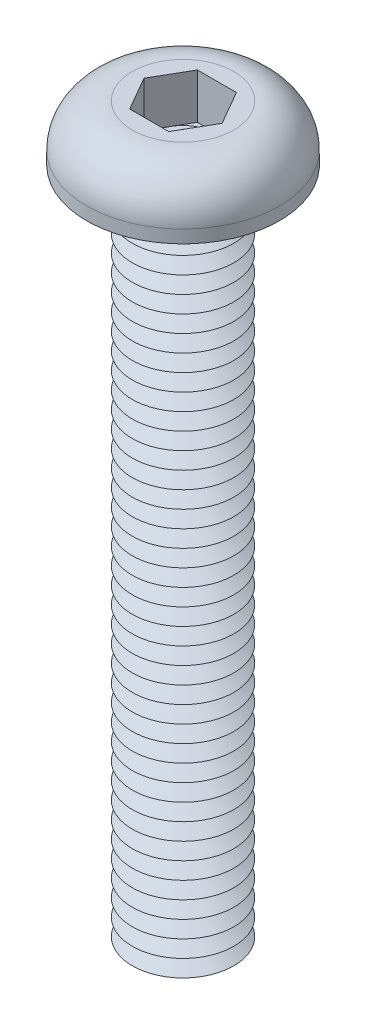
ISO-10303-21;
HEADER;
FILE_DESCRIPTION(('STEP AP214'),'2;1');
FILE_NAME('part.step','',(''),(''),'','','');
FILE_SCHEMA(('AUTOMOTIVE_DESIGN { 1 0 10303 214 1 1 1 1 }'));
ENDSEC;
DATA;
#1=APPLICATION_CONTEXT('core data for automotive mechanical design processes');
#2=APPLICATION_PROTOCOL_DEFINITION('international standard','automotive_design',2000,#1);
#3=PRODUCT_CONTEXT('',#1,'mechanical');
#4=PRODUCT('Part','Part','',(#3));
#5=PRODUCT_RELATED_PRODUCT_CATEGORY('part','',(#4));
#6=PRODUCT_DEFINITION_FORMATION('','',#4);
#7=PRODUCT_DEFINITION_CONTEXT('part definition',#1,'design');
#8=PRODUCT_DEFINITION('design','',#6,#7);
#9=PRODUCT_DEFINITION_SHAPE('','',#8);
#10=(LENGTH_UNIT() NAMED_UNIT(*) SI_UNIT(.MILLI.,.METRE.));
#11=(NAMED_UNIT(*) PLANE_ANGLE_UNIT() SI_UNIT($,.RADIAN.));
#12=(NAMED_UNIT(*) SI_UNIT($,.STERADIAN.) SOLID_ANGLE_UNIT());
#13=UNCERTAINTY_MEASURE_WITH_UNIT(LENGTH_MEASURE(1.E-05),#10,'distance_accuracy_value','');
#14=(GEOMETRIC_REPRESENTATION_CONTEXT(3) GLOBAL_UNCERTAINTY_ASSIGNED_CONTEXT((#13)) GLOBAL_UNIT_ASSIGNED_CONTEXT((#10,
#11,#12)) REPRESENTATION_CONTEXT('',''));
#15=CARTESIAN_POINT('',(0.,0.,0.));
#16=DIRECTION('',(0.,0.,1.));
#17=DIRECTION('',(1.,0.,0.));
#18=AXIS2_PLACEMENT_3D('',#15,#16,#17);
#19=CARTESIAN_POINT('',(0.,0.,0.));
#20=DIRECTION('',(0.,-1.,0.));
#21=DIRECTION('',(0.,0.,-1.));
#22=AXIS2_PLACEMENT_3D('',#19,#20,#21);
#23=TOROIDAL_SURFACE('',#22,1.75,0.25);
#24=CARTESIAN_POINT('',(0.,0.,-2.));
#25=VERTEX_POINT('',#24);
#26=VERTEX_LOOP('',#25);
#27=FACE_BOUND('',#26,.T.);
#28=ADVANCED_FACE('P0_F12',(#27),#23,.T.);
#29=CLOSED_SHELL('',(#28));
#30=MANIFOLD_SOLID_BREP('P0_B1',#29);
#31=CARTESIAN_POINT('',(0.577350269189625,0.31,-1.));
#32=DIRECTION('',(0.,1.,0.));
#33=DIRECTION('',(0.,0.,1.));
#34=AXIS2_PLACEMENT_3D('',#31,#32,#33);
#35=PLANE('',#34);
#36=CARTESIAN_POINT('',(0.,0.31,0.));
#37=DIRECTION('',(0.,1.,0.));
#38=DIRECTION('',(0.,0.,1.));
#39=AXIS2_PLACEMENT_3D('',#36,#37,#38);
#40=CIRCLE('',#39,1.);
#41=CARTESIAN_POINT('',(0.,0.31,1.));
#42=VERTEX_POINT('',#41);
#43=CARTESIAN_POINT('',(0.866025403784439,0.31,0.5));
#44=VERTEX_POINT('',#43);
#45=EDGE_CURVE('P1_E93',#42,#44,#40,.T.);
#46=ORIENTED_EDGE('',*,*,#45,.F.);
#47=DIRECTION('',(1.,0.,0.));
#48=VECTOR('',#47,1.);
#49=CARTESIAN_POINT('',(-0.577350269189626,0.31,1.));
#50=LINE('',#49,#48);
#51=CARTESIAN_POINT('',(0.577350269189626,0.31,1.));
#52=VERTEX_POINT('',#51);
#53=EDGE_CURVE('P1_E116',#42,#52,#50,.T.);
#54=ORIENTED_EDGE('',*,*,#53,.T.);
#55=DIRECTION('',(0.5,0.,-0.866025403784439));
#56=VECTOR('',#55,1.);
#57=CARTESIAN_POINT('',(0.577350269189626,0.31,1.));
#58=LINE('',#57,#56);
#59=EDGE_CURVE('P1_E112',#52,#44,#58,.T.);
#60=ORIENTED_EDGE('',*,*,#59,.T.);
#61=EDGE_LOOP('',(#46,#54,#60));
#62=FACE_BOUND('',#61,.T.);
#63=ADVANCED_FACE('P1_F15',(#62),#35,.T.);
#64=CARTESIAN_POINT('',(0.,0.31,0.));
#65=DIRECTION('',(0.,1.,0.));
#66=DIRECTION('',(0.,0.,1.));
#67=AXIS2_PLACEMENT_3D('',#64,#65,#66);
#68=CIRCLE('',#67,1.);
#69=CARTESIAN_POINT('',(0.866025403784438,0.31,-0.5));
#70=VERTEX_POINT('',#69);
#71=EDGE_CURVE('P1_E10',#44,#70,#68,.T.);
#72=ORIENTED_EDGE('',*,*,#71,.F.);
#73=CARTESIAN_POINT('',(1.15470053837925,0.31,0.));
#74=VERTEX_POINT('',#73);
#75=EDGE_CURVE('P1_E104',#44,#74,#58,.T.);
#76=ORIENTED_EDGE('',*,*,#75,.T.);
#77=DIRECTION('',(-0.5,0.,-0.866025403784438));
#78=VECTOR('',#77,1.);
#79=CARTESIAN_POINT('',(1.15470053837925,0.31,0.));
#80=LINE('',#79,#78);
#81=EDGE_CURVE('P1_E107',#74,#70,#80,.T.);
#82=ORIENTED_EDGE('',*,*,#81,.T.);
#83=EDGE_LOOP('',(#72,#76,#82));
#84=FACE_BOUND('',#83,.T.);
#85=ADVANCED_FACE('P1_F103',(#84),#35,.T.);
#86=CARTESIAN_POINT('',(0.,0.31,-1.));
#87=VERTEX_POINT('',#86);
#88=EDGE_CURVE('P1_E24',#70,#87,#68,.T.);
#89=ORIENTED_EDGE('',*,*,#88,.F.);
#90=CARTESIAN_POINT('',(0.577350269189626,0.31,-1.));
#91=VERTEX_POINT('',#90);
#92=EDGE_CURVE('P1_E139',#70,#91,#80,.T.);
#93=ORIENTED_EDGE('',*,*,#92,.T.);
#94=DIRECTION('',(-1.,0.,0.));
#95=VECTOR('',#94,1.);
#96=CARTESIAN_POINT('',(0.577350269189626,0.31,-1.));
#97=LINE('',#96,#95);
#98=EDGE_CURVE('P1_E456',#91,#87,#97,.T.);
#99=ORIENTED_EDGE('',*,*,#98,.T.);
#100=EDGE_LOOP('',(#89,#93,#99));
#101=FACE_BOUND('',#100,.T.);
#102=ADVANCED_FACE('P1_F421',(#101),#35,.T.);
#103=CARTESIAN_POINT('',(-0.866025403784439,0.31,-0.5));
#104=VERTEX_POINT('',#103);
#105=EDGE_CURVE('P1_E451',#87,#104,#68,.T.);
#106=ORIENTED_EDGE('',*,*,#105,.F.);
#107=CARTESIAN_POINT('',(-0.577350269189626,0.31,-1.));
#108=VERTEX_POINT('',#107);
#109=EDGE_CURVE('P1_E460',#87,#108,#97,.T.);
#110=ORIENTED_EDGE('',*,*,#109,.T.);
#111=DIRECTION('',(-0.5,0.,0.866025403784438));
#112=VECTOR('',#111,1.);
#113=CARTESIAN_POINT('',(-0.577350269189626,0.31,-1.));
#114=LINE('',#113,#112);
#115=EDGE_CURVE('P1_E455',#108,#104,#114,.T.);
#116=ORIENTED_EDGE('',*,*,#115,.T.);
#117=EDGE_LOOP('',(#106,#110,#116));
#118=FACE_BOUND('',#117,.T.);
#119=ADVANCED_FACE('P1_F435',(#118),#35,.T.);
#120=CARTESIAN_POINT('',(-0.866025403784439,0.31,0.5));
#121=VERTEX_POINT('',#120);
#122=EDGE_CURVE('P1_E31',#104,#121,#68,.T.);
#123=ORIENTED_EDGE('',*,*,#122,.F.);
#124=CARTESIAN_POINT('',(-1.15470053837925,0.31,0.));
#125=VERTEX_POINT('',#124);
#126=EDGE_CURVE('P1_E447',#104,#125,#114,.T.);
#127=ORIENTED_EDGE('',*,*,#126,.T.);
#128=DIRECTION('',(0.5,0.,0.866025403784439));
#129=VECTOR('',#128,1.);
#130=CARTESIAN_POINT('',(-1.15470053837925,0.31,0.));
#131=LINE('',#130,#129);
#132=EDGE_CURVE('P1_E450',#125,#121,#131,.T.);
#133=ORIENTED_EDGE('',*,*,#132,.T.);
#134=EDGE_LOOP('',(#123,#127,#133));
#135=FACE_BOUND('',#134,.T.);
#136=ADVANCED_FACE('P1_F426',(#135),#35,.T.);
#137=CARTESIAN_POINT('',(0.,-19.5,0.));
#138=DIRECTION('',(0.,1.,0.));
#139=DIRECTION('',(0.,0.,1.));
#140=AXIS2_PLACEMENT_3D('',#137,#138,#139);
#141=CONICAL_SURFACE('',#140,1.06698729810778,1.0471975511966);
#142=CARTESIAN_POINT('',(0.,-19.25,0.));
#143=DIRECTION('',(0.,-1.,0.));
#144=DIRECTION('',(0.,0.,-1.));
#145=AXIS2_PLACEMENT_3D('',#142,#143,#144);
#146=CIRCLE('',#145,1.5);
#147=CARTESIAN_POINT('',(0.,-19.25,-1.5));
#148=VERTEX_POINT('',#147);
#149=EDGE_CURVE('P1_E383',#148,#148,#146,.T.);
#150=ORIENTED_EDGE('',*,*,#149,.T.);
#151=EDGE_LOOP('',(#150));
#152=FACE_BOUND('',#151,.T.);
#153=CARTESIAN_POINT('',(0.,-19.5,0.));
#154=DIRECTION('',(0.,-1.,0.));
#155=DIRECTION('',(0.,0.,-1.));
#156=AXIS2_PLACEMENT_3D('',#153,#154,#155);
#157=CIRCLE('',#156,1.06698729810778);
#158=CARTESIAN_POINT('',(0.,-19.5,-1.06698729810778));
#159=VERTEX_POINT('',#158);
#160=EDGE_CURVE('P1_E386',#159,#159,#157,.T.);
#161=ORIENTED_EDGE('',*,*,#160,.F.);
#162=EDGE_LOOP('',(#161));
#163=FACE_BOUND('',#162,.T.);
#164=ADVANCED_FACE('P1_F434',(#152,#163),#141,.T.);
#165=CARTESIAN_POINT('',(0.,-19.75,0.));
#166=DIRECTION('',(0.,-1.,0.));
#167=DIRECTION('',(0.,0.,-1.));
#168=AXIS2_PLACEMENT_3D('',#165,#166,#167);
#169=CONICAL_SURFACE('',#168,1.5,1.0471975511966);
#170=ORIENTED_EDGE('',*,*,#160,.T.);
#171=EDGE_LOOP('',(#170));
#172=FACE_BOUND('',#171,.T.);
#173=CARTESIAN_POINT('',(0.,-19.75,0.));
#174=DIRECTION('',(0.,-1.,0.));
#175=DIRECTION('',(0.,0.,-1.));
#176=AXIS2_PLACEMENT_3D('',#173,#174,#175);
#177=CIRCLE('',#176,1.5);
#178=CARTESIAN_POINT('',(0.,-19.75,-1.5));
#179=VERTEX_POINT('',#178);
#180=EDGE_CURVE('P1_E389',#179,#179,#177,.T.);
#181=ORIENTED_EDGE('',*,*,#180,.F.);
#182=EDGE_LOOP('',(#181));
#183=FACE_BOUND('',#182,.T.);
#184=ADVANCED_FACE('P1_F441',(#172,#183),#169,.T.);
#185=CARTESIAN_POINT('',(0.,-20.,0.));
#186=DIRECTION('',(0.,1.,0.));
#187=DIRECTION('',(0.,0.,1.));
#188=AXIS2_PLACEMENT_3D('',#185,#186,#187);
#189=PLANE('',#188);
#190=CARTESIAN_POINT('',(0.,-20.,0.));
#191=DIRECTION('',(0.,-1.,0.));
#192=DIRECTION('',(0.,0.,-1.));
#193=AXIS2_PLACEMENT_3D('',#190,#191,#192);
#194=CIRCLE('',#193,1.06698729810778);
#195=CARTESIAN_POINT('',(0.,-20.,-1.06698729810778));
#196=VERTEX_POINT('',#195);
#197=EDGE_CURVE('P1_E392',#196,#196,#194,.T.);
#198=ORIENTED_EDGE('',*,*,#197,.T.);
#199=EDGE_LOOP('',(#198));
#200=FACE_BOUND('',#199,.T.);
#201=ADVANCED_FACE('P1_F519',(#200),#189,.F.);
#202=CARTESIAN_POINT('',(0.,-20.,0.));
#203=DIRECTION('',(0.,1.,0.));
#204=DIRECTION('',(0.,0.,1.));
#205=AXIS2_PLACEMENT_3D('',#202,#203,#204);
#206=CONICAL_SURFACE('',#205,1.06698729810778,1.0471975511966);
#207=ORIENTED_EDGE('',*,*,#180,.T.);
#208=EDGE_LOOP('',(#207));
#209=FACE_BOUND('',#208,.T.);
#210=ORIENTED_EDGE('',*,*,#197,.F.);
#211=EDGE_LOOP('',(#210));
#212=FACE_BOUND('',#211,.T.);
#213=ADVANCED_FACE('P1_F530',(#209,#212),#206,.T.);
#214=CARTESIAN_POINT('',(0.,-19.,0.));
#215=DIRECTION('',(0.,1.,0.));
#216=DIRECTION('',(0.,0.,1.));
#217=AXIS2_PLACEMENT_3D('',#214,#215,#216);
#218=CONICAL_SURFACE('',#217,1.06698729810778,1.0471975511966);
#219=CARTESIAN_POINT('',(0.,-18.75,0.));
#220=DIRECTION('',(0.,-1.,0.));
#221=DIRECTION('',(0.,0.,-1.));
#222=AXIS2_PLACEMENT_3D('',#219,#220,#221);
#223=CIRCLE('',#222,1.5);
#224=CARTESIAN_POINT('',(0.,-18.75,-1.5));
#225=VERTEX_POINT('',#224);
#226=EDGE_CURVE('P1_E377',#225,#225,#223,.T.);
#227=ORIENTED_EDGE('',*,*,#226,.T.);
#228=EDGE_LOOP('',(#227));
#229=FACE_BOUND('',#228,.T.);
#230=CARTESIAN_POINT('',(0.,-19.,0.));
#231=DIRECTION('',(0.,-1.,0.));
#232=DIRECTION('',(0.,0.,-1.));
#233=AXIS2_PLACEMENT_3D('',#230,#231,#232);
#234=CIRCLE('',#233,1.06698729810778);
#235=CARTESIAN_POINT('',(0.,-19.,-1.06698729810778));
#236=VERTEX_POINT('',#235);
#237=EDGE_CURVE('P1_E380',#236,#236,#234,.T.);
#238=ORIENTED_EDGE('',*,*,#237,.F.);
#239=EDGE_LOOP('',(#238));
#240=FACE_BOUND('',#239,.T.);
#241=ADVANCED_FACE('P1_F539',(#229,#240),#218,.T.);
#242=CARTESIAN_POINT('',(0.,-19.25,0.));
#243=DIRECTION('',(0.,-1.,0.));
#244=DIRECTION('',(0.,0.,-1.));
#245=AXIS2_PLACEMENT_3D('',#242,#243,#244);
#246=CONICAL_SURFACE('',#245,1.5,1.0471975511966);
#247=ORIENTED_EDGE('',*,*,#237,.T.);
#248=EDGE_LOOP('',(#247));
#249=FACE_BOUND('',#248,.T.);
#250=ORIENTED_EDGE('',*,*,#149,.F.);
#251=EDGE_LOOP('',(#250));
#252=FACE_BOUND('',#251,.T.);
#253=ADVANCED_FACE('P1_F548',(#249,#252),#246,.T.);
#254=CARTESIAN_POINT('',(0.,-18.5,0.));
#255=DIRECTION('',(0.,1.,0.));
#256=DIRECTION('',(0.,0.,1.));
#257=AXIS2_PLACEMENT_3D('',#254,#255,#256);
#258=CONICAL_SURFACE('',#257,1.06698729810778,1.0471975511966);
#259=CARTESIAN_POINT('',(0.,-18.25,0.));
#260=DIRECTION('',(0.,-1.,0.));
#261=DIRECTION('',(0.,0.,-1.));
#262=AXIS2_PLACEMENT_3D('',#259,#260,#261);
#263=CIRCLE('',#262,1.5);
#264=CARTESIAN_POINT('',(0.,-18.25,-1.5));
#265=VERTEX_POINT('',#264);
#266=EDGE_CURVE('P1_E371',#265,#265,#263,.T.);
#267=ORIENTED_EDGE('',*,*,#266,.T.);
#268=EDGE_LOOP('',(#267));
#269=FACE_BOUND('',#268,.T.);
#270=CARTESIAN_POINT('',(0.,-18.5,0.));
#271=DIRECTION('',(0.,-1.,0.));
#272=DIRECTION('',(0.,0.,-1.));
#273=AXIS2_PLACEMENT_3D('',#270,#271,#272);
#274=CIRCLE('',#273,1.06698729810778);
#275=CARTESIAN_POINT('',(0.,-18.5,-1.06698729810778));
#276=VERTEX_POINT('',#275);
#277=EDGE_CURVE('P1_E374',#276,#276,#274,.T.);
#278=ORIENTED_EDGE('',*,*,#277,.F.);
#279=EDGE_LOOP('',(#278));
#280=FACE_BOUND('',#279,.T.);
#281=ADVANCED_FACE('P1_F558',(#269,#280),#258,.T.);
#282=CARTESIAN_POINT('',(0.,-18.75,0.));
#283=DIRECTION('',(0.,-1.,0.));
#284=DIRECTION('',(0.,0.,-1.));
#285=AXIS2_PLACEMENT_3D('',#282,#283,#284);
#286=CONICAL_SURFACE('',#285,1.5,1.0471975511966);
#287=ORIENTED_EDGE('',*,*,#277,.T.);
#288=EDGE_LOOP('',(#287));
#289=FACE_BOUND('',#288,.T.);
#290=ORIENTED_EDGE('',*,*,#226,.F.);
#291=EDGE_LOOP('',(#290));
#292=FACE_BOUND('',#291,.T.);
#293=ADVANCED_FACE('P1_F568',(#289,#292),#286,.T.);
#294=CARTESIAN_POINT('',(0.,-18.,0.));
#295=DIRECTION('',(0.,1.,0.));
#296=DIRECTION('',(0.,0.,1.));
#297=AXIS2_PLACEMENT_3D('',#294,#295,#296);
#298=CONICAL_SURFACE('',#297,1.06698729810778,1.0471975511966);
#299=CARTESIAN_POINT('',(0.,-17.75,0.));
#300=DIRECTION('',(0.,-1.,0.));
#301=DIRECTION('',(0.,0.,-1.));
#302=AXIS2_PLACEMENT_3D('',#299,#300,#301);
#303=CIRCLE('',#302,1.5);
#304=CARTESIAN_POINT('',(0.,-17.75,-1.5));
#305=VERTEX_POINT('',#304);
#306=EDGE_CURVE('P1_E365',#305,#305,#303,.T.);
#307=ORIENTED_EDGE('',*,*,#306,.T.);
#308=EDGE_LOOP('',(#307));
#309=FACE_BOUND('',#308,.T.);
#310=CARTESIAN_POINT('',(0.,-18.,0.));
#311=DIRECTION('',(0.,-1.,0.));
#312=DIRECTION('',(0.,0.,-1.));
#313=AXIS2_PLACEMENT_3D('',#310,#311,#312);
#314=CIRCLE('',#313,1.06698729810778);
#315=CARTESIAN_POINT('',(0.,-18.,-1.06698729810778));
#316=VERTEX_POINT('',#315);
#317=EDGE_CURVE('P1_E368',#316,#316,#314,.T.);
#318=ORIENTED_EDGE('',*,*,#317,.F.);
#319=EDGE_LOOP('',(#318));
#320=FACE_BOUND('',#319,.T.);
#321=ADVANCED_FACE('P1_F578',(#309,#320),#298,.T.);
#322=CARTESIAN_POINT('',(0.,-18.25,0.));
#323=DIRECTION('',(0.,-1.,0.));
#324=DIRECTION('',(0.,0.,-1.));
#325=AXIS2_PLACEMENT_3D('',#322,#323,#324);
#326=CONICAL_SURFACE('',#325,1.5,1.0471975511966);
#327=ORIENTED_EDGE('',*,*,#317,.T.);
#328=EDGE_LOOP('',(#327));
#329=FACE_BOUND('',#328,.T.);
#330=ORIENTED_EDGE('',*,*,#266,.F.);
#331=EDGE_LOOP('',(#330));
#332=FACE_BOUND('',#331,.T.);
#333=ADVANCED_FACE('P1_F588',(#329,#332),#326,.T.);
#334=CARTESIAN_POINT('',(0.,-17.5,0.));
#335=DIRECTION('',(0.,1.,0.));
#336=DIRECTION('',(0.,0.,1.));
#337=AXIS2_PLACEMENT_3D('',#334,#335,#336);
#338=CONICAL_SURFACE('',#337,1.06698729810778,1.0471975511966);
#339=CARTESIAN_POINT('',(0.,-17.25,0.));
#340=DIRECTION('',(0.,-1.,0.));
#341=DIRECTION('',(0.,0.,-1.));
#342=AXIS2_PLACEMENT_3D('',#339,#340,#341);
#343=CIRCLE('',#342,1.5);
#344=CARTESIAN_POINT('',(0.,-17.25,-1.5));
#345=VERTEX_POINT('',#344);
#346=EDGE_CURVE('P1_E359',#345,#345,#343,.T.);
#347=ORIENTED_EDGE('',*,*,#346,.T.);
#348=EDGE_LOOP('',(#347));
#349=FACE_BOUND('',#348,.T.);
#350=CARTESIAN_POINT('',(0.,-17.5,0.));
#351=DIRECTION('',(0.,-1.,0.));
#352=DIRECTION('',(0.,0.,-1.));
#353=AXIS2_PLACEMENT_3D('',#350,#351,#352);
#354=CIRCLE('',#353,1.06698729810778);
#355=CARTESIAN_POINT('',(0.,-17.5,-1.06698729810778));
#356=VERTEX_POINT('',#355);
#357=EDGE_CURVE('P1_E362',#356,#356,#354,.T.);
#358=ORIENTED_EDGE('',*,*,#357,.F.);
#359=EDGE_LOOP('',(#358));
#360=FACE_BOUND('',#359,.T.);
#361=ADVANCED_FACE('P1_F598',(#349,#360),#338,.T.);
#362=CARTESIAN_POINT('',(0.,-17.75,0.));
#363=DIRECTION('',(0.,-1.,0.));
#364=DIRECTION('',(0.,0.,-1.));
#365=AXIS2_PLACEMENT_3D('',#362,#363,#364);
#366=CONICAL_SURFACE('',#365,1.5,1.0471975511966);
#367=ORIENTED_EDGE('',*,*,#357,.T.);
#368=EDGE_LOOP('',(#367));
#369=FACE_BOUND('',#368,.T.);
#370=ORIENTED_EDGE('',*,*,#306,.F.);
#371=EDGE_LOOP('',(#370));
#372=FACE_BOUND('',#371,.T.);
#373=ADVANCED_FACE('P1_F608',(#369,#372),#366,.T.);
#374=CARTESIAN_POINT('',(0.,-17.,0.));
#375=DIRECTION('',(0.,1.,0.));
#376=DIRECTION('',(0.,0.,1.));
#377=AXIS2_PLACEMENT_3D('',#374,#375,#376);
#378=CONICAL_SURFACE('',#377,1.06698729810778,1.0471975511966);
#379=CARTESIAN_POINT('',(0.,-16.75,0.));
#380=DIRECTION('',(0.,-1.,0.));
#381=DIRECTION('',(0.,0.,-1.));
#382=AXIS2_PLACEMENT_3D('',#379,#380,#381);
#383=CIRCLE('',#382,1.5);
#384=CARTESIAN_POINT('',(0.,-16.75,-1.5));
#385=VERTEX_POINT('',#384);
#386=EDGE_CURVE('P1_E353',#385,#385,#383,.T.);
#387=ORIENTED_EDGE('',*,*,#386,.T.);
#388=EDGE_LOOP('',(#387));
#389=FACE_BOUND('',#388,.T.);
#390=CARTESIAN_POINT('',(0.,-17.,0.));
#391=DIRECTION('',(0.,-1.,0.));
#392=DIRECTION('',(0.,0.,-1.));
#393=AXIS2_PLACEMENT_3D('',#390,#391,#392);
#394=CIRCLE('',#393,1.06698729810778);
#395=CARTESIAN_POINT('',(0.,-17.,-1.06698729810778));
#396=VERTEX_POINT('',#395);
#397=EDGE_CURVE('P1_E356',#396,#396,#394,.T.);
#398=ORIENTED_EDGE('',*,*,#397,.F.);
#399=EDGE_LOOP('',(#398));
#400=FACE_BOUND('',#399,.T.);
#401=ADVANCED_FACE('P1_F618',(#389,#400),#378,.T.);
#402=CARTESIAN_POINT('',(0.,-17.25,0.));
#403=DIRECTION('',(0.,-1.,0.));
#404=DIRECTION('',(0.,0.,-1.));
#405=AXIS2_PLACEMENT_3D('',#402,#403,#404);
#406=CONICAL_SURFACE('',#405,1.5,1.0471975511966);
#407=ORIENTED_EDGE('',*,*,#397,.T.);
#408=EDGE_LOOP('',(#407));
#409=FACE_BOUND('',#408,.T.);
#410=ORIENTED_EDGE('',*,*,#346,.F.);
#411=EDGE_LOOP('',(#410));
#412=FACE_BOUND('',#411,.T.);
#413=ADVANCED_FACE('P1_F628',(#409,#412),#406,.T.);
#414=CARTESIAN_POINT('',(0.,-16.5,0.));
#415=DIRECTION('',(0.,1.,0.));
#416=DIRECTION('',(0.,0.,1.));
#417=AXIS2_PLACEMENT_3D('',#414,#415,#416);
#418=CONICAL_SURFACE('',#417,1.06698729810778,1.0471975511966);
#419=CARTESIAN_POINT('',(0.,-16.25,0.));
#420=DIRECTION('',(0.,-1.,0.));
#421=DIRECTION('',(0.,0.,-1.));
#422=AXIS2_PLACEMENT_3D('',#419,#420,#421);
#423=CIRCLE('',#422,1.5);
#424=CARTESIAN_POINT('',(0.,-16.25,-1.5));
#425=VERTEX_POINT('',#424);
#426=EDGE_CURVE('P1_E347',#425,#425,#423,.T.);
#427=ORIENTED_EDGE('',*,*,#426,.T.);
#428=EDGE_LOOP('',(#427));
#429=FACE_BOUND('',#428,.T.);
#430=CARTESIAN_POINT('',(0.,-16.5,0.));
#431=DIRECTION('',(0.,-1.,0.));
#432=DIRECTION('',(0.,0.,-1.));
#433=AXIS2_PLACEMENT_3D('',#430,#431,#432);
#434=CIRCLE('',#433,1.06698729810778);
#435=CARTESIAN_POINT('',(0.,-16.5,-1.06698729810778));
#436=VERTEX_POINT('',#435);
#437=EDGE_CURVE('P1_E350',#436,#436,#434,.T.);
#438=ORIENTED_EDGE('',*,*,#437,.F.);
#439=EDGE_LOOP('',(#438));
#440=FACE_BOUND('',#439,.T.);
#441=ADVANCED_FACE('P1_F638',(#429,#440),#418,.T.);
#442=CARTESIAN_POINT('',(0.,-16.75,0.));
#443=DIRECTION('',(0.,-1.,0.));
#444=DIRECTION('',(0.,0.,-1.));
#445=AXIS2_PLACEMENT_3D('',#442,#443,#444);
#446=CONICAL_SURFACE('',#445,1.5,1.0471975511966);
#447=ORIENTED_EDGE('',*,*,#437,.T.);
#448=EDGE_LOOP('',(#447));
#449=FACE_BOUND('',#448,.T.);
#450=ORIENTED_EDGE('',*,*,#386,.F.);
#451=EDGE_LOOP('',(#450));
#452=FACE_BOUND('',#451,.T.);
#453=ADVANCED_FACE('P1_F648',(#449,#452),#446,.T.);
#454=CARTESIAN_POINT('',(0.,-16.,0.));
#455=DIRECTION('',(0.,1.,0.));
#456=DIRECTION('',(0.,0.,1.));
#457=AXIS2_PLACEMENT_3D('',#454,#455,#456);
#458=CONICAL_SURFACE('',#457,1.06698729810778,1.0471975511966);
#459=CARTESIAN_POINT('',(0.,-15.75,0.));
#460=DIRECTION('',(0.,-1.,0.));
#461=DIRECTION('',(0.,0.,-1.));
#462=AXIS2_PLACEMENT_3D('',#459,#460,#461);
#463=CIRCLE('',#462,1.5);
#464=CARTESIAN_POINT('',(0.,-15.75,-1.5));
#465=VERTEX_POINT('',#464);
#466=EDGE_CURVE('P1_E341',#465,#465,#463,.T.);
#467=ORIENTED_EDGE('',*,*,#466,.T.);
#468=EDGE_LOOP('',(#467));
#469=FACE_BOUND('',#468,.T.);
#470=CARTESIAN_POINT('',(0.,-16.,0.));
#471=DIRECTION('',(0.,-1.,0.));
#472=DIRECTION('',(0.,0.,-1.));
#473=AXIS2_PLACEMENT_3D('',#470,#471,#472);
#474=CIRCLE('',#473,1.06698729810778);
#475=CARTESIAN_POINT('',(0.,-16.,-1.06698729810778));
#476=VERTEX_POINT('',#475);
#477=EDGE_CURVE('P1_E344',#476,#476,#474,.T.);
#478=ORIENTED_EDGE('',*,*,#477,.F.);
#479=EDGE_LOOP('',(#478));
#480=FACE_BOUND('',#479,.T.);
#481=ADVANCED_FACE('P1_F658',(#469,#480),#458,.T.);
#482=CARTESIAN_POINT('',(0.,-16.25,0.));
#483=DIRECTION('',(0.,-1.,0.));
#484=DIRECTION('',(0.,0.,-1.));
#485=AXIS2_PLACEMENT_3D('',#482,#483,#484);
#486=CONICAL_SURFACE('',#485,1.5,1.0471975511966);
#487=ORIENTED_EDGE('',*,*,#477,.T.);
#488=EDGE_LOOP('',(#487));
#489=FACE_BOUND('',#488,.T.);
#490=ORIENTED_EDGE('',*,*,#426,.F.);
#491=EDGE_LOOP('',(#490));
#492=FACE_BOUND('',#491,.T.);
#493=ADVANCED_FACE('P1_F668',(#489,#492),#486,.T.);
#494=CARTESIAN_POINT('',(0.,-15.5,0.));
#495=DIRECTION('',(0.,1.,0.));
#496=DIRECTION('',(0.,0.,1.));
#497=AXIS2_PLACEMENT_3D('',#494,#495,#496);
#498=CONICAL_SURFACE('',#497,1.06698729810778,1.0471975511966);
#499=CARTESIAN_POINT('',(0.,-15.25,0.));
#500=DIRECTION('',(0.,-1.,0.));
#501=DIRECTION('',(0.,0.,-1.));
#502=AXIS2_PLACEMENT_3D('',#499,#500,#501);
#503=CIRCLE('',#502,1.5);
#504=CARTESIAN_POINT('',(0.,-15.25,-1.5));
#505=VERTEX_POINT('',#504);
#506=EDGE_CURVE('P1_E335',#505,#505,#503,.T.);
#507=ORIENTED_EDGE('',*,*,#506,.T.);
#508=EDGE_LOOP('',(#507));
#509=FACE_BOUND('',#508,.T.);
#510=CARTESIAN_POINT('',(0.,-15.5,0.));
#511=DIRECTION('',(0.,-1.,0.));
#512=DIRECTION('',(0.,0.,-1.));
#513=AXIS2_PLACEMENT_3D('',#510,#511,#512);
#514=CIRCLE('',#513,1.06698729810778);
#515=CARTESIAN_POINT('',(0.,-15.5,-1.06698729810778));
#516=VERTEX_POINT('',#515);
#517=EDGE_CURVE('P1_E338',#516,#516,#514,.T.);
#518=ORIENTED_EDGE('',*,*,#517,.F.);
#519=EDGE_LOOP('',(#518));
#520=FACE_BOUND('',#519,.T.);
#521=ADVANCED_FACE('P1_F678',(#509,#520),#498,.T.);
#522=CARTESIAN_POINT('',(0.,-15.75,0.));
#523=DIRECTION('',(0.,-1.,0.));
#524=DIRECTION('',(0.,0.,-1.));
#525=AXIS2_PLACEMENT_3D('',#522,#523,#524);
#526=CONICAL_SURFACE('',#525,1.5,1.0471975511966);
#527=ORIENTED_EDGE('',*,*,#517,.T.);
#528=EDGE_LOOP('',(#527));
#529=FACE_BOUND('',#528,.T.);
#530=ORIENTED_EDGE('',*,*,#466,.F.);
#531=EDGE_LOOP('',(#530));
#532=FACE_BOUND('',#531,.T.);
#533=ADVANCED_FACE('P1_F688',(#529,#532),#526,.T.);
#534=CARTESIAN_POINT('',(0.,-15.,0.));
#535=DIRECTION('',(0.,1.,0.));
#536=DIRECTION('',(0.,0.,1.));
#537=AXIS2_PLACEMENT_3D('',#534,#535,#536);
#538=CONICAL_SURFACE('',#537,1.06698729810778,1.0471975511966);
#539=CARTESIAN_POINT('',(0.,-14.75,0.));
#540=DIRECTION('',(0.,-1.,0.));
#541=DIRECTION('',(0.,0.,-1.));
#542=AXIS2_PLACEMENT_3D('',#539,#540,#541);
#543=CIRCLE('',#542,1.5);
#544=CARTESIAN_POINT('',(0.,-14.75,-1.5));
#545=VERTEX_POINT('',#544);
#546=EDGE_CURVE('P1_E329',#545,#545,#543,.T.);
#547=ORIENTED_EDGE('',*,*,#546,.T.);
#548=EDGE_LOOP('',(#547));
#549=FACE_BOUND('',#548,.T.);
#550=CARTESIAN_POINT('',(0.,-15.,0.));
#551=DIRECTION('',(0.,-1.,0.));
#552=DIRECTION('',(0.,0.,-1.));
#553=AXIS2_PLACEMENT_3D('',#550,#551,#552);
#554=CIRCLE('',#553,1.06698729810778);
#555=CARTESIAN_POINT('',(0.,-15.,-1.06698729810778));
#556=VERTEX_POINT('',#555);
#557=EDGE_CURVE('P1_E332',#556,#556,#554,.T.);
#558=ORIENTED_EDGE('',*,*,#557,.F.);
#559=EDGE_LOOP('',(#558));
#560=FACE_BOUND('',#559,.T.);
#561=ADVANCED_FACE('P1_F698',(#549,#560),#538,.T.);
#562=CARTESIAN_POINT('',(0.,-15.25,0.));
#563=DIRECTION('',(0.,-1.,0.));
#564=DIRECTION('',(0.,0.,-1.));
#565=AXIS2_PLACEMENT_3D('',#562,#563,#564);
#566=CONICAL_SURFACE('',#565,1.5,1.0471975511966);
#567=ORIENTED_EDGE('',*,*,#557,.T.);
#568=EDGE_LOOP('',(#567));
#569=FACE_BOUND('',#568,.T.);
#570=ORIENTED_EDGE('',*,*,#506,.F.);
#571=EDGE_LOOP('',(#570));
#572=FACE_BOUND('',#571,.T.);
#573=ADVANCED_FACE('P1_F708',(#569,#572),#566,.T.);
#574=CARTESIAN_POINT('',(0.,-14.5,0.));
#575=DIRECTION('',(0.,1.,0.));
#576=DIRECTION('',(0.,0.,1.));
#577=AXIS2_PLACEMENT_3D('',#574,#575,#576);
#578=CONICAL_SURFACE('',#577,1.06698729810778,1.0471975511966);
#579=CARTESIAN_POINT('',(0.,-14.25,0.));
#580=DIRECTION('',(0.,-1.,0.));
#581=DIRECTION('',(0.,0.,-1.));
#582=AXIS2_PLACEMENT_3D('',#579,#580,#581);
#583=CIRCLE('',#582,1.5);
#584=CARTESIAN_POINT('',(0.,-14.25,-1.5));
#585=VERTEX_POINT('',#584);
#586=EDGE_CURVE('P1_E323',#585,#585,#583,.T.);
#587=ORIENTED_EDGE('',*,*,#586,.T.);
#588=EDGE_LOOP('',(#587));
#589=FACE_BOUND('',#588,.T.);
#590=CARTESIAN_POINT('',(0.,-14.5,0.));
#591=DIRECTION('',(0.,-1.,0.));
#592=DIRECTION('',(0.,0.,-1.));
#593=AXIS2_PLACEMENT_3D('',#590,#591,#592);
#594=CIRCLE('',#593,1.06698729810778);
#595=CARTESIAN_POINT('',(0.,-14.5,-1.06698729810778));
#596=VERTEX_POINT('',#595);
#597=EDGE_CURVE('P1_E326',#596,#596,#594,.T.);
#598=ORIENTED_EDGE('',*,*,#597,.F.);
#599=EDGE_LOOP('',(#598));
#600=FACE_BOUND('',#599,.T.);
#601=ADVANCED_FACE('P1_F718',(#589,#600),#578,.T.);
#602=CARTESIAN_POINT('',(0.,-14.75,0.));
#603=DIRECTION('',(0.,-1.,0.));
#604=DIRECTION('',(0.,0.,-1.));
#605=AXIS2_PLACEMENT_3D('',#602,#603,#604);
#606=CONICAL_SURFACE('',#605,1.5,1.0471975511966);
#607=ORIENTED_EDGE('',*,*,#597,.T.);
#608=EDGE_LOOP('',(#607));
#609=FACE_BOUND('',#608,.T.);
#610=ORIENTED_EDGE('',*,*,#546,.F.);
#611=EDGE_LOOP('',(#610));
#612=FACE_BOUND('',#611,.T.);
#613=ADVANCED_FACE('P1_F728',(#609,#612),#606,.T.);
#614=CARTESIAN_POINT('',(0.,-14.,0.));
#615=DIRECTION('',(0.,1.,0.));
#616=DIRECTION('',(0.,0.,1.));
#617=AXIS2_PLACEMENT_3D('',#614,#615,#616);
#618=CONICAL_SURFACE('',#617,1.06698729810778,1.0471975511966);
#619=CARTESIAN_POINT('',(0.,-13.75,0.));
#620=DIRECTION('',(0.,-1.,0.));
#621=DIRECTION('',(0.,0.,-1.));
#622=AXIS2_PLACEMENT_3D('',#619,#620,#621);
#623=CIRCLE('',#622,1.5);
#624=CARTESIAN_POINT('',(0.,-13.75,-1.5));
#625=VERTEX_POINT('',#624);
#626=EDGE_CURVE('P1_E317',#625,#625,#623,.T.);
#627=ORIENTED_EDGE('',*,*,#626,.T.);
#628=EDGE_LOOP('',(#627));
#629=FACE_BOUND('',#628,.T.);
#630=CARTESIAN_POINT('',(0.,-14.,0.));
#631=DIRECTION('',(0.,-1.,0.));
#632=DIRECTION('',(0.,0.,-1.));
#633=AXIS2_PLACEMENT_3D('',#630,#631,#632);
#634=CIRCLE('',#633,1.06698729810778);
#635=CARTESIAN_POINT('',(0.,-14.,-1.06698729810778));
#636=VERTEX_POINT('',#635);
#637=EDGE_CURVE('P1_E320',#636,#636,#634,.T.);
#638=ORIENTED_EDGE('',*,*,#637,.F.);
#639=EDGE_LOOP('',(#638));
#640=FACE_BOUND('',#639,.T.);
#641=ADVANCED_FACE('P1_F738',(#629,#640),#618,.T.);
#642=CARTESIAN_POINT('',(0.,-14.25,0.));
#643=DIRECTION('',(0.,-1.,0.));
#644=DIRECTION('',(0.,0.,-1.));
#645=AXIS2_PLACEMENT_3D('',#642,#643,#644);
#646=CONICAL_SURFACE('',#645,1.5,1.0471975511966);
#647=ORIENTED_EDGE('',*,*,#637,.T.);
#648=EDGE_LOOP('',(#647));
#649=FACE_BOUND('',#648,.T.);
#650=ORIENTED_EDGE('',*,*,#586,.F.);
#651=EDGE_LOOP('',(#650));
#652=FACE_BOUND('',#651,.T.);
#653=ADVANCED_FACE('P1_F748',(#649,#652),#646,.T.);
#654=CARTESIAN_POINT('',(0.,-13.5,0.));
#655=DIRECTION('',(0.,1.,0.));
#656=DIRECTION('',(0.,0.,1.));
#657=AXIS2_PLACEMENT_3D('',#654,#655,#656);
#658=CONICAL_SURFACE('',#657,1.06698729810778,1.0471975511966);
#659=CARTESIAN_POINT('',(0.,-13.25,0.));
#660=DIRECTION('',(0.,-1.,0.));
#661=DIRECTION('',(0.,0.,-1.));
#662=AXIS2_PLACEMENT_3D('',#659,#660,#661);
#663=CIRCLE('',#662,1.5);
#664=CARTESIAN_POINT('',(0.,-13.25,-1.5));
#665=VERTEX_POINT('',#664);
#666=EDGE_CURVE('P1_E311',#665,#665,#663,.T.);
#667=ORIENTED_EDGE('',*,*,#666,.T.);
#668=EDGE_LOOP('',(#667));
#669=FACE_BOUND('',#668,.T.);
#670=CARTESIAN_POINT('',(0.,-13.5,0.));
#671=DIRECTION('',(0.,-1.,0.));
#672=DIRECTION('',(0.,0.,-1.));
#673=AXIS2_PLACEMENT_3D('',#670,#671,#672);
#674=CIRCLE('',#673,1.06698729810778);
#675=CARTESIAN_POINT('',(0.,-13.5,-1.06698729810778));
#676=VERTEX_POINT('',#675);
#677=EDGE_CURVE('P1_E314',#676,#676,#674,.T.);
#678=ORIENTED_EDGE('',*,*,#677,.F.);
#679=EDGE_LOOP('',(#678));
#680=FACE_BOUND('',#679,.T.);
#681=ADVANCED_FACE('P1_F758',(#669,#680),#658,.T.);
#682=CARTESIAN_POINT('',(0.,-13.75,0.));
#683=DIRECTION('',(0.,-1.,0.));
#684=DIRECTION('',(0.,0.,-1.));
#685=AXIS2_PLACEMENT_3D('',#682,#683,#684);
#686=CONICAL_SURFACE('',#685,1.5,1.0471975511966);
#687=ORIENTED_EDGE('',*,*,#677,.T.);
#688=EDGE_LOOP('',(#687));
#689=FACE_BOUND('',#688,.T.);
#690=ORIENTED_EDGE('',*,*,#626,.F.);
#691=EDGE_LOOP('',(#690));
#692=FACE_BOUND('',#691,.T.);
#693=ADVANCED_FACE('P1_F768',(#689,#692),#686,.T.);
#694=CARTESIAN_POINT('',(0.,-13.,0.));
#695=DIRECTION('',(0.,1.,0.));
#696=DIRECTION('',(0.,0.,1.));
#697=AXIS2_PLACEMENT_3D('',#694,#695,#696);
#698=CONICAL_SURFACE('',#697,1.06698729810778,1.0471975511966);
#699=CARTESIAN_POINT('',(0.,-12.75,0.));
#700=DIRECTION('',(0.,-1.,0.));
#701=DIRECTION('',(0.,0.,-1.));
#702=AXIS2_PLACEMENT_3D('',#699,#700,#701);
#703=CIRCLE('',#702,1.5);
#704=CARTESIAN_POINT('',(0.,-12.75,-1.5));
#705=VERTEX_POINT('',#704);
#706=EDGE_CURVE('P1_E305',#705,#705,#703,.T.);
#707=ORIENTED_EDGE('',*,*,#706,.T.);
#708=EDGE_LOOP('',(#707));
#709=FACE_BOUND('',#708,.T.);
#710=CARTESIAN_POINT('',(0.,-13.,0.));
#711=DIRECTION('',(0.,-1.,0.));
#712=DIRECTION('',(0.,0.,-1.));
#713=AXIS2_PLACEMENT_3D('',#710,#711,#712);
#714=CIRCLE('',#713,1.06698729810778);
#715=CARTESIAN_POINT('',(0.,-13.,-1.06698729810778));
#716=VERTEX_POINT('',#715);
#717=EDGE_CURVE('P1_E308',#716,#716,#714,.T.);
#718=ORIENTED_EDGE('',*,*,#717,.F.);
#719=EDGE_LOOP('',(#718));
#720=FACE_BOUND('',#719,.T.);
#721=ADVANCED_FACE('P1_F778',(#709,#720),#698,.T.);
#722=CARTESIAN_POINT('',(0.,-13.25,0.));
#723=DIRECTION('',(0.,-1.,0.));
#724=DIRECTION('',(0.,0.,-1.));
#725=AXIS2_PLACEMENT_3D('',#722,#723,#724);
#726=CONICAL_SURFACE('',#725,1.5,1.0471975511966);
#727=ORIENTED_EDGE('',*,*,#717,.T.);
#728=EDGE_LOOP('',(#727));
#729=FACE_BOUND('',#728,.T.);
#730=ORIENTED_EDGE('',*,*,#666,.F.);
#731=EDGE_LOOP('',(#730));
#732=FACE_BOUND('',#731,.T.);
#733=ADVANCED_FACE('P1_F788',(#729,#732),#726,.T.);
#734=CARTESIAN_POINT('',(0.,-12.5,0.));
#735=DIRECTION('',(0.,1.,0.));
#736=DIRECTION('',(0.,0.,1.));
#737=AXIS2_PLACEMENT_3D('',#734,#735,#736);
#738=CONICAL_SURFACE('',#737,1.06698729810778,1.0471975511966);
#739=CARTESIAN_POINT('',(0.,-12.25,0.));
#740=DIRECTION('',(0.,-1.,0.));
#741=DIRECTION('',(0.,0.,-1.));
#742=AXIS2_PLACEMENT_3D('',#739,#740,#741);
#743=CIRCLE('',#742,1.5);
#744=CARTESIAN_POINT('',(0.,-12.25,-1.5));
#745=VERTEX_POINT('',#744);
#746=EDGE_CURVE('P1_E299',#745,#745,#743,.T.);
#747=ORIENTED_EDGE('',*,*,#746,.T.);
#748=EDGE_LOOP('',(#747));
#749=FACE_BOUND('',#748,.T.);
#750=CARTESIAN_POINT('',(0.,-12.5,0.));
#751=DIRECTION('',(0.,-1.,0.));
#752=DIRECTION('',(0.,0.,-1.));
#753=AXIS2_PLACEMENT_3D('',#750,#751,#752);
#754=CIRCLE('',#753,1.06698729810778);
#755=CARTESIAN_POINT('',(0.,-12.5,-1.06698729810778));
#756=VERTEX_POINT('',#755);
#757=EDGE_CURVE('P1_E302',#756,#756,#754,.T.);
#758=ORIENTED_EDGE('',*,*,#757,.F.);
#759=EDGE_LOOP('',(#758));
#760=FACE_BOUND('',#759,.T.);
#761=ADVANCED_FACE('P1_F798',(#749,#760),#738,.T.);
#762=CARTESIAN_POINT('',(0.,-12.75,0.));
#763=DIRECTION('',(0.,-1.,0.));
#764=DIRECTION('',(0.,0.,-1.));
#765=AXIS2_PLACEMENT_3D('',#762,#763,#764);
#766=CONICAL_SURFACE('',#765,1.5,1.0471975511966);
#767=ORIENTED_EDGE('',*,*,#757,.T.);
#768=EDGE_LOOP('',(#767));
#769=FACE_BOUND('',#768,.T.);
#770=ORIENTED_EDGE('',*,*,#706,.F.);
#771=EDGE_LOOP('',(#770));
#772=FACE_BOUND('',#771,.T.);
#773=ADVANCED_FACE('P1_F808',(#769,#772),#766,.T.);
#774=CARTESIAN_POINT('',(0.,-12.,0.));
#775=DIRECTION('',(0.,1.,0.));
#776=DIRECTION('',(0.,0.,1.));
#777=AXIS2_PLACEMENT_3D('',#774,#775,#776);
#778=CONICAL_SURFACE('',#777,1.06698729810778,1.0471975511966);
#779=CARTESIAN_POINT('',(0.,-11.75,0.));
#780=DIRECTION('',(0.,-1.,0.));
#781=DIRECTION('',(0.,0.,-1.));
#782=AXIS2_PLACEMENT_3D('',#779,#780,#781);
#783=CIRCLE('',#782,1.5);
#784=CARTESIAN_POINT('',(0.,-11.75,-1.5));
#785=VERTEX_POINT('',#784);
#786=EDGE_CURVE('P1_E293',#785,#785,#783,.T.);
#787=ORIENTED_EDGE('',*,*,#786,.T.);
#788=EDGE_LOOP('',(#787));
#789=FACE_BOUND('',#788,.T.);
#790=CARTESIAN_POINT('',(0.,-12.,0.));
#791=DIRECTION('',(0.,-1.,0.));
#792=DIRECTION('',(0.,0.,-1.));
#793=AXIS2_PLACEMENT_3D('',#790,#791,#792);
#794=CIRCLE('',#793,1.06698729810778);
#795=CARTESIAN_POINT('',(0.,-12.,-1.06698729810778));
#796=VERTEX_POINT('',#795);
#797=EDGE_CURVE('P1_E296',#796,#796,#794,.T.);
#798=ORIENTED_EDGE('',*,*,#797,.F.);
#799=EDGE_LOOP('',(#798));
#800=FACE_BOUND('',#799,.T.);
#801=ADVANCED_FACE('P1_F818',(#789,#800),#778,.T.);
#802=CARTESIAN_POINT('',(0.,-12.25,0.));
#803=DIRECTION('',(0.,-1.,0.));
#804=DIRECTION('',(0.,0.,-1.));
#805=AXIS2_PLACEMENT_3D('',#802,#803,#804);
#806=CONICAL_SURFACE('',#805,1.5,1.0471975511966);
#807=ORIENTED_EDGE('',*,*,#797,.T.);
#808=EDGE_LOOP('',(#807));
#809=FACE_BOUND('',#808,.T.);
#810=ORIENTED_EDGE('',*,*,#746,.F.);
#811=EDGE_LOOP('',(#810));
#812=FACE_BOUND('',#811,.T.);
#813=ADVANCED_FACE('P1_F828',(#809,#812),#806,.T.);
#814=CARTESIAN_POINT('',(0.,-11.5,0.));
#815=DIRECTION('',(0.,1.,0.));
#816=DIRECTION('',(0.,0.,1.));
#817=AXIS2_PLACEMENT_3D('',#814,#815,#816);
#818=CONICAL_SURFACE('',#817,1.06698729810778,1.0471975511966);
#819=CARTESIAN_POINT('',(0.,-11.25,0.));
#820=DIRECTION('',(0.,-1.,0.));
#821=DIRECTION('',(0.,0.,-1.));
#822=AXIS2_PLACEMENT_3D('',#819,#820,#821);
#823=CIRCLE('',#822,1.5);
#824=CARTESIAN_POINT('',(0.,-11.25,-1.5));
#825=VERTEX_POINT('',#824);
#826=EDGE_CURVE('P1_E287',#825,#825,#823,.T.);
#827=ORIENTED_EDGE('',*,*,#826,.T.);
#828=EDGE_LOOP('',(#827));
#829=FACE_BOUND('',#828,.T.);
#830=CARTESIAN_POINT('',(0.,-11.5,0.));
#831=DIRECTION('',(0.,-1.,0.));
#832=DIRECTION('',(0.,0.,-1.));
#833=AXIS2_PLACEMENT_3D('',#830,#831,#832);
#834=CIRCLE('',#833,1.06698729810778);
#835=CARTESIAN_POINT('',(0.,-11.5,-1.06698729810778));
#836=VERTEX_POINT('',#835);
#837=EDGE_CURVE('P1_E290',#836,#836,#834,.T.);
#838=ORIENTED_EDGE('',*,*,#837,.F.);
#839=EDGE_LOOP('',(#838));
#840=FACE_BOUND('',#839,.T.);
#841=ADVANCED_FACE('P1_F838',(#829,#840),#818,.T.);
#842=CARTESIAN_POINT('',(0.,-11.75,0.));
#843=DIRECTION('',(0.,-1.,0.));
#844=DIRECTION('',(0.,0.,-1.));
#845=AXIS2_PLACEMENT_3D('',#842,#843,#844);
#846=CONICAL_SURFACE('',#845,1.5,1.0471975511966);
#847=ORIENTED_EDGE('',*,*,#837,.T.);
#848=EDGE_LOOP('',(#847));
#849=FACE_BOUND('',#848,.T.);
#850=ORIENTED_EDGE('',*,*,#786,.F.);
#851=EDGE_LOOP('',(#850));
#852=FACE_BOUND('',#851,.T.);
#853=ADVANCED_FACE('P1_F848',(#849,#852),#846,.T.);
#854=CARTESIAN_POINT('',(0.,-11.,0.));
#855=DIRECTION('',(0.,1.,0.));
#856=DIRECTION('',(0.,0.,1.));
#857=AXIS2_PLACEMENT_3D('',#854,#855,#856);
#858=CONICAL_SURFACE('',#857,1.06698729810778,1.0471975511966);
#859=CARTESIAN_POINT('',(0.,-10.75,0.));
#860=DIRECTION('',(0.,-1.,0.));
#861=DIRECTION('',(0.,0.,-1.));
#862=AXIS2_PLACEMENT_3D('',#859,#860,#861);
#863=CIRCLE('',#862,1.5);
#864=CARTESIAN_POINT('',(0.,-10.75,-1.5));
#865=VERTEX_POINT('',#864);
#866=EDGE_CURVE('P1_E281',#865,#865,#863,.T.);
#867=ORIENTED_EDGE('',*,*,#866,.T.);
#868=EDGE_LOOP('',(#867));
#869=FACE_BOUND('',#868,.T.);
#870=CARTESIAN_POINT('',(0.,-11.,0.));
#871=DIRECTION('',(0.,-1.,0.));
#872=DIRECTION('',(0.,0.,-1.));
#873=AXIS2_PLACEMENT_3D('',#870,#871,#872);
#874=CIRCLE('',#873,1.06698729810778);
#875=CARTESIAN_POINT('',(0.,-11.,-1.06698729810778));
#876=VERTEX_POINT('',#875);
#877=EDGE_CURVE('P1_E284',#876,#876,#874,.T.);
#878=ORIENTED_EDGE('',*,*,#877,.F.);
#879=EDGE_LOOP('',(#878));
#880=FACE_BOUND('',#879,.T.);
#881=ADVANCED_FACE('P1_F858',(#869,#880),#858,.T.);
#882=CARTESIAN_POINT('',(0.,-11.25,0.));
#883=DIRECTION('',(0.,-1.,0.));
#884=DIRECTION('',(0.,0.,-1.));
#885=AXIS2_PLACEMENT_3D('',#882,#883,#884);
#886=CONICAL_SURFACE('',#885,1.5,1.0471975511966);
#887=ORIENTED_EDGE('',*,*,#877,.T.);
#888=EDGE_LOOP('',(#887));
#889=FACE_BOUND('',#888,.T.);
#890=ORIENTED_EDGE('',*,*,#826,.F.);
#891=EDGE_LOOP('',(#890));
#892=FACE_BOUND('',#891,.T.);
#893=ADVANCED_FACE('P1_F868',(#889,#892),#886,.T.);
#894=CARTESIAN_POINT('',(0.,-10.5,0.));
#895=DIRECTION('',(0.,1.,0.));
#896=DIRECTION('',(0.,0.,1.));
#897=AXIS2_PLACEMENT_3D('',#894,#895,#896);
#898=CONICAL_SURFACE('',#897,1.06698729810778,1.0471975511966);
#899=CARTESIAN_POINT('',(0.,-10.25,0.));
#900=DIRECTION('',(0.,-1.,0.));
#901=DIRECTION('',(0.,0.,-1.));
#902=AXIS2_PLACEMENT_3D('',#899,#900,#901);
#903=CIRCLE('',#902,1.5);
#904=CARTESIAN_POINT('',(0.,-10.25,-1.5));
#905=VERTEX_POINT('',#904);
#906=EDGE_CURVE('P1_E275',#905,#905,#903,.T.);
#907=ORIENTED_EDGE('',*,*,#906,.T.);
#908=EDGE_LOOP('',(#907));
#909=FACE_BOUND('',#908,.T.);
#910=CARTESIAN_POINT('',(0.,-10.5,0.));
#911=DIRECTION('',(0.,-1.,0.));
#912=DIRECTION('',(0.,0.,-1.));
#913=AXIS2_PLACEMENT_3D('',#910,#911,#912);
#914=CIRCLE('',#913,1.06698729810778);
#915=CARTESIAN_POINT('',(0.,-10.5,-1.06698729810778));
#916=VERTEX_POINT('',#915);
#917=EDGE_CURVE('P1_E278',#916,#916,#914,.T.);
#918=ORIENTED_EDGE('',*,*,#917,.F.);
#919=EDGE_LOOP('',(#918));
#920=FACE_BOUND('',#919,.T.);
#921=ADVANCED_FACE('P1_F878',(#909,#920),#898,.T.);
#922=CARTESIAN_POINT('',(0.,-10.75,0.));
#923=DIRECTION('',(0.,-1.,0.));
#924=DIRECTION('',(0.,0.,-1.));
#925=AXIS2_PLACEMENT_3D('',#922,#923,#924);
#926=CONICAL_SURFACE('',#925,1.5,1.0471975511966);
#927=ORIENTED_EDGE('',*,*,#917,.T.);
#928=EDGE_LOOP('',(#927));
#929=FACE_BOUND('',#928,.T.);
#930=ORIENTED_EDGE('',*,*,#866,.F.);
#931=EDGE_LOOP('',(#930));
#932=FACE_BOUND('',#931,.T.);
#933=ADVANCED_FACE('P1_F888',(#929,#932),#926,.T.);
#934=CARTESIAN_POINT('',(0.,-10.,0.));
#935=DIRECTION('',(0.,1.,0.));
#936=DIRECTION('',(0.,0.,1.));
#937=AXIS2_PLACEMENT_3D('',#934,#935,#936);
#938=CONICAL_SURFACE('',#937,1.06698729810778,1.0471975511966);
#939=CARTESIAN_POINT('',(0.,-9.75,0.));
#940=DIRECTION('',(0.,-1.,0.));
#941=DIRECTION('',(0.,0.,-1.));
#942=AXIS2_PLACEMENT_3D('',#939,#940,#941);
#943=CIRCLE('',#942,1.5);
#944=CARTESIAN_POINT('',(0.,-9.75,-1.5));
#945=VERTEX_POINT('',#944);
#946=EDGE_CURVE('P1_E269',#945,#945,#943,.T.);
#947=ORIENTED_EDGE('',*,*,#946,.T.);
#948=EDGE_LOOP('',(#947));
#949=FACE_BOUND('',#948,.T.);
#950=CARTESIAN_POINT('',(0.,-10.,0.));
#951=DIRECTION('',(0.,-1.,0.));
#952=DIRECTION('',(0.,0.,-1.));
#953=AXIS2_PLACEMENT_3D('',#950,#951,#952);
#954=CIRCLE('',#953,1.06698729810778);
#955=CARTESIAN_POINT('',(0.,-10.,-1.06698729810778));
#956=VERTEX_POINT('',#955);
#957=EDGE_CURVE('P1_E272',#956,#956,#954,.T.);
#958=ORIENTED_EDGE('',*,*,#957,.F.);
#959=EDGE_LOOP('',(#958));
#960=FACE_BOUND('',#959,.T.);
#961=ADVANCED_FACE('P1_F898',(#949,#960),#938,.T.);
#962=CARTESIAN_POINT('',(0.,-10.25,0.));
#963=DIRECTION('',(0.,-1.,0.));
#964=DIRECTION('',(0.,0.,-1.));
#965=AXIS2_PLACEMENT_3D('',#962,#963,#964);
#966=CONICAL_SURFACE('',#965,1.5,1.0471975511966);
#967=ORIENTED_EDGE('',*,*,#957,.T.);
#968=EDGE_LOOP('',(#967));
#969=FACE_BOUND('',#968,.T.);
#970=ORIENTED_EDGE('',*,*,#906,.F.);
#971=EDGE_LOOP('',(#970));
#972=FACE_BOUND('',#971,.T.);
#973=ADVANCED_FACE('P1_F908',(#969,#972),#966,.T.);
#974=CARTESIAN_POINT('',(0.,-9.5,0.));
#975=DIRECTION('',(0.,1.,0.));
#976=DIRECTION('',(0.,0.,1.));
#977=AXIS2_PLACEMENT_3D('',#974,#975,#976);
#978=CONICAL_SURFACE('',#977,1.06698729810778,1.0471975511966);
#979=CARTESIAN_POINT('',(0.,-9.25,0.));
#980=DIRECTION('',(0.,-1.,0.));
#981=DIRECTION('',(0.,0.,-1.));
#982=AXIS2_PLACEMENT_3D('',#979,#980,#981);
#983=CIRCLE('',#982,1.5);
#984=CARTESIAN_POINT('',(0.,-9.25,-1.5));
#985=VERTEX_POINT('',#984);
#986=EDGE_CURVE('P1_E263',#985,#985,#983,.T.);
#987=ORIENTED_EDGE('',*,*,#986,.T.);
#988=EDGE_LOOP('',(#987));
#989=FACE_BOUND('',#988,.T.);
#990=CARTESIAN_POINT('',(0.,-9.5,0.));
#991=DIRECTION('',(0.,-1.,0.));
#992=DIRECTION('',(0.,0.,-1.));
#993=AXIS2_PLACEMENT_3D('',#990,#991,#992);
#994=CIRCLE('',#993,1.06698729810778);
#995=CARTESIAN_POINT('',(0.,-9.5,-1.06698729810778));
#996=VERTEX_POINT('',#995);
#997=EDGE_CURVE('P1_E266',#996,#996,#994,.T.);
#998=ORIENTED_EDGE('',*,*,#997,.F.);
#999=EDGE_LOOP('',(#998));
#1000=FACE_BOUND('',#999,.T.);
#1001=ADVANCED_FACE('P1_F918',(#989,#1000),#978,.T.);
#1002=CARTESIAN_POINT('',(0.,-9.75,0.));
#1003=DIRECTION('',(0.,-1.,0.));
#1004=DIRECTION('',(0.,0.,-1.));
#1005=AXIS2_PLACEMENT_3D('',#1002,#1003,#1004);
#1006=CONICAL_SURFACE('',#1005,1.5,1.0471975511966);
#1007=ORIENTED_EDGE('',*,*,#997,.T.);
#1008=EDGE_LOOP('',(#1007));
#1009=FACE_BOUND('',#1008,.T.);
#1010=ORIENTED_EDGE('',*,*,#946,.F.);
#1011=EDGE_LOOP('',(#1010));
#1012=FACE_BOUND('',#1011,.T.);
#1013=ADVANCED_FACE('P1_F928',(#1009,#1012),#1006,.T.);
#1014=CARTESIAN_POINT('',(0.,-9.,0.));
#1015=DIRECTION('',(0.,1.,0.));
#1016=DIRECTION('',(0.,0.,1.));
#1017=AXIS2_PLACEMENT_3D('',#1014,#1015,#1016);
#1018=CONICAL_SURFACE('',#1017,1.06698729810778,1.0471975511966);
#1019=CARTESIAN_POINT('',(0.,-8.75,0.));
#1020=DIRECTION('',(0.,-1.,0.));
#1021=DIRECTION('',(0.,0.,-1.));
#1022=AXIS2_PLACEMENT_3D('',#1019,#1020,#1021);
#1023=CIRCLE('',#1022,1.5);
#1024=CARTESIAN_POINT('',(0.,-8.75,-1.5));
#1025=VERTEX_POINT('',#1024);
#1026=EDGE_CURVE('P1_E257',#1025,#1025,#1023,.T.);
#1027=ORIENTED_EDGE('',*,*,#1026,.T.);
#1028=EDGE_LOOP('',(#1027));
#1029=FACE_BOUND('',#1028,.T.);
#1030=CARTESIAN_POINT('',(0.,-9.,0.));
#1031=DIRECTION('',(0.,-1.,0.));
#1032=DIRECTION('',(0.,0.,-1.));
#1033=AXIS2_PLACEMENT_3D('',#1030,#1031,#1032);
#1034=CIRCLE('',#1033,1.06698729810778);
#1035=CARTESIAN_POINT('',(0.,-9.,-1.06698729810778));
#1036=VERTEX_POINT('',#1035);
#1037=EDGE_CURVE('P1_E260',#1036,#1036,#1034,.T.);
#1038=ORIENTED_EDGE('',*,*,#1037,.F.);
#1039=EDGE_LOOP('',(#1038));
#1040=FACE_BOUND('',#1039,.T.);
#1041=ADVANCED_FACE('P1_F938',(#1029,#1040),#1018,.T.);
#1042=CARTESIAN_POINT('',(0.,-9.25,0.));
#1043=DIRECTION('',(0.,-1.,0.));
#1044=DIRECTION('',(0.,0.,-1.));
#1045=AXIS2_PLACEMENT_3D('',#1042,#1043,#1044);
#1046=CONICAL_SURFACE('',#1045,1.5,1.0471975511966);
#1047=ORIENTED_EDGE('',*,*,#1037,.T.);
#1048=EDGE_LOOP('',(#1047));
#1049=FACE_BOUND('',#1048,.T.);
#1050=ORIENTED_EDGE('',*,*,#986,.F.);
#1051=EDGE_LOOP('',(#1050));
#1052=FACE_BOUND('',#1051,.T.);
#1053=ADVANCED_FACE('P1_F948',(#1049,#1052),#1046,.T.);
#1054=CARTESIAN_POINT('',(0.,-8.5,0.));
#1055=DIRECTION('',(0.,1.,0.));
#1056=DIRECTION('',(0.,0.,1.));
#1057=AXIS2_PLACEMENT_3D('',#1054,#1055,#1056);
#1058=CONICAL_SURFACE('',#1057,1.06698729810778,1.0471975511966);
#1059=CARTESIAN_POINT('',(0.,-8.25,0.));
#1060=DIRECTION('',(0.,-1.,0.));
#1061=DIRECTION('',(0.,0.,-1.));
#1062=AXIS2_PLACEMENT_3D('',#1059,#1060,#1061);
#1063=CIRCLE('',#1062,1.5);
#1064=CARTESIAN_POINT('',(0.,-8.25,-1.5));
#1065=VERTEX_POINT('',#1064);
#1066=EDGE_CURVE('P1_E251',#1065,#1065,#1063,.T.);
#1067=ORIENTED_EDGE('',*,*,#1066,.T.);
#1068=EDGE_LOOP('',(#1067));
#1069=FACE_BOUND('',#1068,.T.);
#1070=CARTESIAN_POINT('',(0.,-8.5,0.));
#1071=DIRECTION('',(0.,-1.,0.));
#1072=DIRECTION('',(0.,0.,-1.));
#1073=AXIS2_PLACEMENT_3D('',#1070,#1071,#1072);
#1074=CIRCLE('',#1073,1.06698729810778);
#1075=CARTESIAN_POINT('',(0.,-8.5,-1.06698729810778));
#1076=VERTEX_POINT('',#1075);
#1077=EDGE_CURVE('P1_E254',#1076,#1076,#1074,.T.);
#1078=ORIENTED_EDGE('',*,*,#1077,.F.);
#1079=EDGE_LOOP('',(#1078));
#1080=FACE_BOUND('',#1079,.T.);
#1081=ADVANCED_FACE('P1_F958',(#1069,#1080),#1058,.T.);
#1082=CARTESIAN_POINT('',(0.,-8.75,0.));
#1083=DIRECTION('',(0.,-1.,0.));
#1084=DIRECTION('',(0.,0.,-1.));
#1085=AXIS2_PLACEMENT_3D('',#1082,#1083,#1084);
#1086=CONICAL_SURFACE('',#1085,1.5,1.0471975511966);
#1087=ORIENTED_EDGE('',*,*,#1077,.T.);
#1088=EDGE_LOOP('',(#1087));
#1089=FACE_BOUND('',#1088,.T.);
#1090=ORIENTED_EDGE('',*,*,#1026,.F.);
#1091=EDGE_LOOP('',(#1090));
#1092=FACE_BOUND('',#1091,.T.);
#1093=ADVANCED_FACE('P1_F968',(#1089,#1092),#1086,.T.);
#1094=CARTESIAN_POINT('',(0.,-8.,0.));
#1095=DIRECTION('',(0.,1.,0.));
#1096=DIRECTION('',(0.,0.,1.));
#1097=AXIS2_PLACEMENT_3D('',#1094,#1095,#1096);
#1098=CONICAL_SURFACE('',#1097,1.06698729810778,1.0471975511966);
#1099=CARTESIAN_POINT('',(0.,-7.75,0.));
#1100=DIRECTION('',(0.,-1.,0.));
#1101=DIRECTION('',(0.,0.,-1.));
#1102=AXIS2_PLACEMENT_3D('',#1099,#1100,#1101);
#1103=CIRCLE('',#1102,1.5);
#1104=CARTESIAN_POINT('',(0.,-7.75,-1.5));
#1105=VERTEX_POINT('',#1104);
#1106=EDGE_CURVE('P1_E245',#1105,#1105,#1103,.T.);
#1107=ORIENTED_EDGE('',*,*,#1106,.T.);
#1108=EDGE_LOOP('',(#1107));
#1109=FACE_BOUND('',#1108,.T.);
#1110=CARTESIAN_POINT('',(0.,-8.,0.));
#1111=DIRECTION('',(0.,-1.,0.));
#1112=DIRECTION('',(0.,0.,-1.));
#1113=AXIS2_PLACEMENT_3D('',#1110,#1111,#1112);
#1114=CIRCLE('',#1113,1.06698729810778);
#1115=CARTESIAN_POINT('',(0.,-8.,-1.06698729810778));
#1116=VERTEX_POINT('',#1115);
#1117=EDGE_CURVE('P1_E248',#1116,#1116,#1114,.T.);
#1118=ORIENTED_EDGE('',*,*,#1117,.F.);
#1119=EDGE_LOOP('',(#1118));
#1120=FACE_BOUND('',#1119,.T.);
#1121=ADVANCED_FACE('P1_F978',(#1109,#1120),#1098,.T.);
#1122=CARTESIAN_POINT('',(0.,-8.25,0.));
#1123=DIRECTION('',(0.,-1.,0.));
#1124=DIRECTION('',(0.,0.,-1.));
#1125=AXIS2_PLACEMENT_3D('',#1122,#1123,#1124);
#1126=CONICAL_SURFACE('',#1125,1.5,1.0471975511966);
#1127=ORIENTED_EDGE('',*,*,#1117,.T.);
#1128=EDGE_LOOP('',(#1127));
#1129=FACE_BOUND('',#1128,.T.);
#1130=ORIENTED_EDGE('',*,*,#1066,.F.);
#1131=EDGE_LOOP('',(#1130));
#1132=FACE_BOUND('',#1131,.T.);
#1133=ADVANCED_FACE('P1_F988',(#1129,#1132),#1126,.T.);
#1134=CARTESIAN_POINT('',(0.,-7.5,0.));
#1135=DIRECTION('',(0.,1.,0.));
#1136=DIRECTION('',(0.,0.,1.));
#1137=AXIS2_PLACEMENT_3D('',#1134,#1135,#1136);
#1138=CONICAL_SURFACE('',#1137,1.06698729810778,1.0471975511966);
#1139=CARTESIAN_POINT('',(0.,-7.25,0.));
#1140=DIRECTION('',(0.,-1.,0.));
#1141=DIRECTION('',(0.,0.,-1.));
#1142=AXIS2_PLACEMENT_3D('',#1139,#1140,#1141);
#1143=CIRCLE('',#1142,1.5);
#1144=CARTESIAN_POINT('',(0.,-7.25,-1.5));
#1145=VERTEX_POINT('',#1144);
#1146=EDGE_CURVE('P1_E239',#1145,#1145,#1143,.T.);
#1147=ORIENTED_EDGE('',*,*,#1146,.T.);
#1148=EDGE_LOOP('',(#1147));
#1149=FACE_BOUND('',#1148,.T.);
#1150=CARTESIAN_POINT('',(0.,-7.5,0.));
#1151=DIRECTION('',(0.,-1.,0.));
#1152=DIRECTION('',(0.,0.,-1.));
#1153=AXIS2_PLACEMENT_3D('',#1150,#1151,#1152);
#1154=CIRCLE('',#1153,1.06698729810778);
#1155=CARTESIAN_POINT('',(0.,-7.5,-1.06698729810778));
#1156=VERTEX_POINT('',#1155);
#1157=EDGE_CURVE('P1_E242',#1156,#1156,#1154,.T.);
#1158=ORIENTED_EDGE('',*,*,#1157,.F.);
#1159=EDGE_LOOP('',(#1158));
#1160=FACE_BOUND('',#1159,.T.);
#1161=ADVANCED_FACE('P1_F998',(#1149,#1160),#1138,.T.);
#1162=CARTESIAN_POINT('',(0.,-7.75,0.));
#1163=DIRECTION('',(0.,-1.,0.));
#1164=DIRECTION('',(0.,0.,-1.));
#1165=AXIS2_PLACEMENT_3D('',#1162,#1163,#1164);
#1166=CONICAL_SURFACE('',#1165,1.5,1.0471975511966);
#1167=ORIENTED_EDGE('',*,*,#1157,.T.);
#1168=EDGE_LOOP('',(#1167));
#1169=FACE_BOUND('',#1168,.T.);
#1170=ORIENTED_EDGE('',*,*,#1106,.F.);
#1171=EDGE_LOOP('',(#1170));
#1172=FACE_BOUND('',#1171,.T.);
#1173=ADVANCED_FACE('P1_F1008',(#1169,#1172),#1166,.T.);
#1174=CARTESIAN_POINT('',(0.,-7.,0.));
#1175=DIRECTION('',(0.,1.,0.));
#1176=DIRECTION('',(0.,0.,1.));
#1177=AXIS2_PLACEMENT_3D('',#1174,#1175,#1176);
#1178=CONICAL_SURFACE('',#1177,1.06698729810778,1.0471975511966);
#1179=CARTESIAN_POINT('',(0.,-6.75,0.));
#1180=DIRECTION('',(0.,-1.,0.));
#1181=DIRECTION('',(0.,0.,-1.));
#1182=AXIS2_PLACEMENT_3D('',#1179,#1180,#1181);
#1183=CIRCLE('',#1182,1.5);
#1184=CARTESIAN_POINT('',(0.,-6.75,-1.5));
#1185=VERTEX_POINT('',#1184);
#1186=EDGE_CURVE('P1_E233',#1185,#1185,#1183,.T.);
#1187=ORIENTED_EDGE('',*,*,#1186,.T.);
#1188=EDGE_LOOP('',(#1187));
#1189=FACE_BOUND('',#1188,.T.);
#1190=CARTESIAN_POINT('',(0.,-7.,0.));
#1191=DIRECTION('',(0.,-1.,0.));
#1192=DIRECTION('',(0.,0.,-1.));
#1193=AXIS2_PLACEMENT_3D('',#1190,#1191,#1192);
#1194=CIRCLE('',#1193,1.06698729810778);
#1195=CARTESIAN_POINT('',(0.,-7.,-1.06698729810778));
#1196=VERTEX_POINT('',#1195);
#1197=EDGE_CURVE('P1_E236',#1196,#1196,#1194,.T.);
#1198=ORIENTED_EDGE('',*,*,#1197,.F.);
#1199=EDGE_LOOP('',(#1198));
#1200=FACE_BOUND('',#1199,.T.);
#1201=ADVANCED_FACE('P1_F1018',(#1189,#1200),#1178,.T.);
#1202=CARTESIAN_POINT('',(0.,-7.25,0.));
#1203=DIRECTION('',(0.,-1.,0.));
#1204=DIRECTION('',(0.,0.,-1.));
#1205=AXIS2_PLACEMENT_3D('',#1202,#1203,#1204);
#1206=CONICAL_SURFACE('',#1205,1.5,1.0471975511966);
#1207=ORIENTED_EDGE('',*,*,#1197,.T.);
#1208=EDGE_LOOP('',(#1207));
#1209=FACE_BOUND('',#1208,.T.);
#1210=ORIENTED_EDGE('',*,*,#1146,.F.);
#1211=EDGE_LOOP('',(#1210));
#1212=FACE_BOUND('',#1211,.T.);
#1213=ADVANCED_FACE('P1_F1028',(#1209,#1212),#1206,.T.);
#1214=CARTESIAN_POINT('',(0.,-6.5,0.));
#1215=DIRECTION('',(0.,1.,0.));
#1216=DIRECTION('',(0.,0.,1.));
#1217=AXIS2_PLACEMENT_3D('',#1214,#1215,#1216);
#1218=CONICAL_SURFACE('',#1217,1.06698729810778,1.0471975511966);
#1219=CARTESIAN_POINT('',(0.,-6.25,0.));
#1220=DIRECTION('',(0.,-1.,0.));
#1221=DIRECTION('',(0.,0.,-1.));
#1222=AXIS2_PLACEMENT_3D('',#1219,#1220,#1221);
#1223=CIRCLE('',#1222,1.5);
#1224=CARTESIAN_POINT('',(0.,-6.25,-1.5));
#1225=VERTEX_POINT('',#1224);
#1226=EDGE_CURVE('P1_E227',#1225,#1225,#1223,.T.);
#1227=ORIENTED_EDGE('',*,*,#1226,.T.);
#1228=EDGE_LOOP('',(#1227));
#1229=FACE_BOUND('',#1228,.T.);
#1230=CARTESIAN_POINT('',(0.,-6.5,0.));
#1231=DIRECTION('',(0.,-1.,0.));
#1232=DIRECTION('',(0.,0.,-1.));
#1233=AXIS2_PLACEMENT_3D('',#1230,#1231,#1232);
#1234=CIRCLE('',#1233,1.06698729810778);
#1235=CARTESIAN_POINT('',(0.,-6.5,-1.06698729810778));
#1236=VERTEX_POINT('',#1235);
#1237=EDGE_CURVE('P1_E230',#1236,#1236,#1234,.T.);
#1238=ORIENTED_EDGE('',*,*,#1237,.F.);
#1239=EDGE_LOOP('',(#1238));
#1240=FACE_BOUND('',#1239,.T.);
#1241=ADVANCED_FACE('P1_F1038',(#1229,#1240),#1218,.T.);
#1242=CARTESIAN_POINT('',(0.,-6.75,0.));
#1243=DIRECTION('',(0.,-1.,0.));
#1244=DIRECTION('',(0.,0.,-1.));
#1245=AXIS2_PLACEMENT_3D('',#1242,#1243,#1244);
#1246=CONICAL_SURFACE('',#1245,1.5,1.0471975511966);
#1247=ORIENTED_EDGE('',*,*,#1237,.T.);
#1248=EDGE_LOOP('',(#1247));
#1249=FACE_BOUND('',#1248,.T.);
#1250=ORIENTED_EDGE('',*,*,#1186,.F.);
#1251=EDGE_LOOP('',(#1250));
#1252=FACE_BOUND('',#1251,.T.);
#1253=ADVANCED_FACE('P1_F1048',(#1249,#1252),#1246,.T.);
#1254=CARTESIAN_POINT('',(0.,-6.,0.));
#1255=DIRECTION('',(0.,1.,0.));
#1256=DIRECTION('',(0.,0.,1.));
#1257=AXIS2_PLACEMENT_3D('',#1254,#1255,#1256);
#1258=CONICAL_SURFACE('',#1257,1.06698729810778,1.0471975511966);
#1259=CARTESIAN_POINT('',(0.,-5.75,0.));
#1260=DIRECTION('',(0.,-1.,0.));
#1261=DIRECTION('',(0.,0.,-1.));
#1262=AXIS2_PLACEMENT_3D('',#1259,#1260,#1261);
#1263=CIRCLE('',#1262,1.5);
#1264=CARTESIAN_POINT('',(0.,-5.75,-1.5));
#1265=VERTEX_POINT('',#1264);
#1266=EDGE_CURVE('P1_E221',#1265,#1265,#1263,.T.);
#1267=ORIENTED_EDGE('',*,*,#1266,.T.);
#1268=EDGE_LOOP('',(#1267));
#1269=FACE_BOUND('',#1268,.T.);
#1270=CARTESIAN_POINT('',(0.,-6.,0.));
#1271=DIRECTION('',(0.,-1.,0.));
#1272=DIRECTION('',(0.,0.,-1.));
#1273=AXIS2_PLACEMENT_3D('',#1270,#1271,#1272);
#1274=CIRCLE('',#1273,1.06698729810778);
#1275=CARTESIAN_POINT('',(0.,-6.,-1.06698729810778));
#1276=VERTEX_POINT('',#1275);
#1277=EDGE_CURVE('P1_E224',#1276,#1276,#1274,.T.);
#1278=ORIENTED_EDGE('',*,*,#1277,.F.);
#1279=EDGE_LOOP('',(#1278));
#1280=FACE_BOUND('',#1279,.T.);
#1281=ADVANCED_FACE('P1_F1058',(#1269,#1280),#1258,.T.);
#1282=CARTESIAN_POINT('',(0.,-6.25,0.));
#1283=DIRECTION('',(0.,-1.,0.));
#1284=DIRECTION('',(0.,0.,-1.));
#1285=AXIS2_PLACEMENT_3D('',#1282,#1283,#1284);
#1286=CONICAL_SURFACE('',#1285,1.5,1.0471975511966);
#1287=ORIENTED_EDGE('',*,*,#1277,.T.);
#1288=EDGE_LOOP('',(#1287));
#1289=FACE_BOUND('',#1288,.T.);
#1290=ORIENTED_EDGE('',*,*,#1226,.F.);
#1291=EDGE_LOOP('',(#1290));
#1292=FACE_BOUND('',#1291,.T.);
#1293=ADVANCED_FACE('P1_F1068',(#1289,#1292),#1286,.T.);
#1294=CARTESIAN_POINT('',(0.,-5.5,0.));
#1295=DIRECTION('',(0.,1.,0.));
#1296=DIRECTION('',(0.,0.,1.));
#1297=AXIS2_PLACEMENT_3D('',#1294,#1295,#1296);
#1298=CONICAL_SURFACE('',#1297,1.06698729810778,1.0471975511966);
#1299=CARTESIAN_POINT('',(0.,-5.25,0.));
#1300=DIRECTION('',(0.,-1.,0.));
#1301=DIRECTION('',(0.,0.,-1.));
#1302=AXIS2_PLACEMENT_3D('',#1299,#1300,#1301);
#1303=CIRCLE('',#1302,1.5);
#1304=CARTESIAN_POINT('',(0.,-5.25,-1.5));
#1305=VERTEX_POINT('',#1304);
#1306=EDGE_CURVE('P1_E215',#1305,#1305,#1303,.T.);
#1307=ORIENTED_EDGE('',*,*,#1306,.T.);
#1308=EDGE_LOOP('',(#1307));
#1309=FACE_BOUND('',#1308,.T.);
#1310=CARTESIAN_POINT('',(0.,-5.5,0.));
#1311=DIRECTION('',(0.,-1.,0.));
#1312=DIRECTION('',(0.,0.,-1.));
#1313=AXIS2_PLACEMENT_3D('',#1310,#1311,#1312);
#1314=CIRCLE('',#1313,1.06698729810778);
#1315=CARTESIAN_POINT('',(0.,-5.5,-1.06698729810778));
#1316=VERTEX_POINT('',#1315);
#1317=EDGE_CURVE('P1_E218',#1316,#1316,#1314,.T.);
#1318=ORIENTED_EDGE('',*,*,#1317,.F.);
#1319=EDGE_LOOP('',(#1318));
#1320=FACE_BOUND('',#1319,.T.);
#1321=ADVANCED_FACE('P1_F1078',(#1309,#1320),#1298,.T.);
#1322=CARTESIAN_POINT('',(0.,-5.75,0.));
#1323=DIRECTION('',(0.,-1.,0.));
#1324=DIRECTION('',(0.,0.,-1.));
#1325=AXIS2_PLACEMENT_3D('',#1322,#1323,#1324);
#1326=CONICAL_SURFACE('',#1325,1.5,1.0471975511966);
#1327=ORIENTED_EDGE('',*,*,#1317,.T.);
#1328=EDGE_LOOP('',(#1327));
#1329=FACE_BOUND('',#1328,.T.);
#1330=ORIENTED_EDGE('',*,*,#1266,.F.);
#1331=EDGE_LOOP('',(#1330));
#1332=FACE_BOUND('',#1331,.T.);
#1333=ADVANCED_FACE('P1_F1088',(#1329,#1332),#1326,.T.);
#1334=CARTESIAN_POINT('',(0.,-5.,0.));
#1335=DIRECTION('',(0.,1.,0.));
#1336=DIRECTION('',(0.,0.,1.));
#1337=AXIS2_PLACEMENT_3D('',#1334,#1335,#1336);
#1338=CONICAL_SURFACE('',#1337,1.06698729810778,1.0471975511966);
#1339=CARTESIAN_POINT('',(0.,-4.75,0.));
#1340=DIRECTION('',(0.,-1.,0.));
#1341=DIRECTION('',(0.,0.,-1.));
#1342=AXIS2_PLACEMENT_3D('',#1339,#1340,#1341);
#1343=CIRCLE('',#1342,1.5);
#1344=CARTESIAN_POINT('',(0.,-4.75,-1.5));
#1345=VERTEX_POINT('',#1344);
#1346=EDGE_CURVE('P1_E209',#1345,#1345,#1343,.T.);
#1347=ORIENTED_EDGE('',*,*,#1346,.T.);
#1348=EDGE_LOOP('',(#1347));
#1349=FACE_BOUND('',#1348,.T.);
#1350=CARTESIAN_POINT('',(0.,-5.,0.));
#1351=DIRECTION('',(0.,-1.,0.));
#1352=DIRECTION('',(0.,0.,-1.));
#1353=AXIS2_PLACEMENT_3D('',#1350,#1351,#1352);
#1354=CIRCLE('',#1353,1.06698729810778);
#1355=CARTESIAN_POINT('',(0.,-5.,-1.06698729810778));
#1356=VERTEX_POINT('',#1355);
#1357=EDGE_CURVE('P1_E212',#1356,#1356,#1354,.T.);
#1358=ORIENTED_EDGE('',*,*,#1357,.F.);
#1359=EDGE_LOOP('',(#1358));
#1360=FACE_BOUND('',#1359,.T.);
#1361=ADVANCED_FACE('P1_F1098',(#1349,#1360),#1338,.T.);
#1362=CARTESIAN_POINT('',(0.,-5.25,0.));
#1363=DIRECTION('',(0.,-1.,0.));
#1364=DIRECTION('',(0.,0.,-1.));
#1365=AXIS2_PLACEMENT_3D('',#1362,#1363,#1364);
#1366=CONICAL_SURFACE('',#1365,1.5,1.0471975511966);
#1367=ORIENTED_EDGE('',*,*,#1357,.T.);
#1368=EDGE_LOOP('',(#1367));
#1369=FACE_BOUND('',#1368,.T.);
#1370=ORIENTED_EDGE('',*,*,#1306,.F.);
#1371=EDGE_LOOP('',(#1370));
#1372=FACE_BOUND('',#1371,.T.);
#1373=ADVANCED_FACE('P1_F1108',(#1369,#1372),#1366,.T.);
#1374=CARTESIAN_POINT('',(0.,-4.5,0.));
#1375=DIRECTION('',(0.,1.,0.));
#1376=DIRECTION('',(0.,0.,1.));
#1377=AXIS2_PLACEMENT_3D('',#1374,#1375,#1376);
#1378=CONICAL_SURFACE('',#1377,1.06698729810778,1.0471975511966);
#1379=CARTESIAN_POINT('',(0.,-4.25,0.));
#1380=DIRECTION('',(0.,-1.,0.));
#1381=DIRECTION('',(0.,0.,-1.));
#1382=AXIS2_PLACEMENT_3D('',#1379,#1380,#1381);
#1383=CIRCLE('',#1382,1.5);
#1384=CARTESIAN_POINT('',(0.,-4.25,-1.5));
#1385=VERTEX_POINT('',#1384);
#1386=EDGE_CURVE('P1_E203',#1385,#1385,#1383,.T.);
#1387=ORIENTED_EDGE('',*,*,#1386,.T.);
#1388=EDGE_LOOP('',(#1387));
#1389=FACE_BOUND('',#1388,.T.);
#1390=CARTESIAN_POINT('',(0.,-4.5,0.));
#1391=DIRECTION('',(0.,-1.,0.));
#1392=DIRECTION('',(0.,0.,-1.));
#1393=AXIS2_PLACEMENT_3D('',#1390,#1391,#1392);
#1394=CIRCLE('',#1393,1.06698729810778);
#1395=CARTESIAN_POINT('',(0.,-4.5,-1.06698729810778));
#1396=VERTEX_POINT('',#1395);
#1397=EDGE_CURVE('P1_E206',#1396,#1396,#1394,.T.);
#1398=ORIENTED_EDGE('',*,*,#1397,.F.);
#1399=EDGE_LOOP('',(#1398));
#1400=FACE_BOUND('',#1399,.T.);
#1401=ADVANCED_FACE('P1_F1118',(#1389,#1400),#1378,.T.);
#1402=CARTESIAN_POINT('',(0.,-4.75,0.));
#1403=DIRECTION('',(0.,-1.,0.));
#1404=DIRECTION('',(0.,0.,-1.));
#1405=AXIS2_PLACEMENT_3D('',#1402,#1403,#1404);
#1406=CONICAL_SURFACE('',#1405,1.5,1.0471975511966);
#1407=ORIENTED_EDGE('',*,*,#1397,.T.);
#1408=EDGE_LOOP('',(#1407));
#1409=FACE_BOUND('',#1408,.T.);
#1410=ORIENTED_EDGE('',*,*,#1346,.F.);
#1411=EDGE_LOOP('',(#1410));
#1412=FACE_BOUND('',#1411,.T.);
#1413=ADVANCED_FACE('P1_F1128',(#1409,#1412),#1406,.T.);
#1414=CARTESIAN_POINT('',(0.,-4.,0.));
#1415=DIRECTION('',(0.,1.,0.));
#1416=DIRECTION('',(0.,0.,1.));
#1417=AXIS2_PLACEMENT_3D('',#1414,#1415,#1416);
#1418=CONICAL_SURFACE('',#1417,1.06698729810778,1.0471975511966);
#1419=CARTESIAN_POINT('',(0.,-3.75,0.));
#1420=DIRECTION('',(0.,-1.,0.));
#1421=DIRECTION('',(0.,0.,-1.));
#1422=AXIS2_PLACEMENT_3D('',#1419,#1420,#1421);
#1423=CIRCLE('',#1422,1.5);
#1424=CARTESIAN_POINT('',(0.,-3.75,-1.5));
#1425=VERTEX_POINT('',#1424);
#1426=EDGE_CURVE('P1_E197',#1425,#1425,#1423,.T.);
#1427=ORIENTED_EDGE('',*,*,#1426,.T.);
#1428=EDGE_LOOP('',(#1427));
#1429=FACE_BOUND('',#1428,.T.);
#1430=CARTESIAN_POINT('',(0.,-4.,0.));
#1431=DIRECTION('',(0.,-1.,0.));
#1432=DIRECTION('',(0.,0.,-1.));
#1433=AXIS2_PLACEMENT_3D('',#1430,#1431,#1432);
#1434=CIRCLE('',#1433,1.06698729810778);
#1435=CARTESIAN_POINT('',(0.,-4.,-1.06698729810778));
#1436=VERTEX_POINT('',#1435);
#1437=EDGE_CURVE('P1_E200',#1436,#1436,#1434,.T.);
#1438=ORIENTED_EDGE('',*,*,#1437,.F.);
#1439=EDGE_LOOP('',(#1438));
#1440=FACE_BOUND('',#1439,.T.);
#1441=ADVANCED_FACE('P1_F1138',(#1429,#1440),#1418,.T.);
#1442=CARTESIAN_POINT('',(0.,-4.25,0.));
#1443=DIRECTION('',(0.,-1.,0.));
#1444=DIRECTION('',(0.,0.,-1.));
#1445=AXIS2_PLACEMENT_3D('',#1442,#1443,#1444);
#1446=CONICAL_SURFACE('',#1445,1.5,1.0471975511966);
#1447=ORIENTED_EDGE('',*,*,#1437,.T.);
#1448=EDGE_LOOP('',(#1447));
#1449=FACE_BOUND('',#1448,.T.);
#1450=ORIENTED_EDGE('',*,*,#1386,.F.);
#1451=EDGE_LOOP('',(#1450));
#1452=FACE_BOUND('',#1451,.T.);
#1453=ADVANCED_FACE('P1_F1148',(#1449,#1452),#1446,.T.);
#1454=CARTESIAN_POINT('',(0.,-3.5,0.));
#1455=DIRECTION('',(0.,1.,0.));
#1456=DIRECTION('',(0.,0.,1.));
#1457=AXIS2_PLACEMENT_3D('',#1454,#1455,#1456);
#1458=CONICAL_SURFACE('',#1457,1.06698729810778,1.0471975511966);
#1459=CARTESIAN_POINT('',(0.,-3.25,0.));
#1460=DIRECTION('',(0.,-1.,0.));
#1461=DIRECTION('',(0.,0.,-1.));
#1462=AXIS2_PLACEMENT_3D('',#1459,#1460,#1461);
#1463=CIRCLE('',#1462,1.5);
#1464=CARTESIAN_POINT('',(0.,-3.25,-1.5));
#1465=VERTEX_POINT('',#1464);
#1466=EDGE_CURVE('P1_E191',#1465,#1465,#1463,.T.);
#1467=ORIENTED_EDGE('',*,*,#1466,.T.);
#1468=EDGE_LOOP('',(#1467));
#1469=FACE_BOUND('',#1468,.T.);
#1470=CARTESIAN_POINT('',(0.,-3.5,0.));
#1471=DIRECTION('',(0.,-1.,0.));
#1472=DIRECTION('',(0.,0.,-1.));
#1473=AXIS2_PLACEMENT_3D('',#1470,#1471,#1472);
#1474=CIRCLE('',#1473,1.06698729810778);
#1475=CARTESIAN_POINT('',(0.,-3.5,-1.06698729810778));
#1476=VERTEX_POINT('',#1475);
#1477=EDGE_CURVE('P1_E194',#1476,#1476,#1474,.T.);
#1478=ORIENTED_EDGE('',*,*,#1477,.F.);
#1479=EDGE_LOOP('',(#1478));
#1480=FACE_BOUND('',#1479,.T.);
#1481=ADVANCED_FACE('P1_F1158',(#1469,#1480),#1458,.T.);
#1482=CARTESIAN_POINT('',(0.,-3.75,0.));
#1483=DIRECTION('',(0.,-1.,0.));
#1484=DIRECTION('',(0.,0.,-1.));
#1485=AXIS2_PLACEMENT_3D('',#1482,#1483,#1484);
#1486=CONICAL_SURFACE('',#1485,1.5,1.0471975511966);
#1487=ORIENTED_EDGE('',*,*,#1477,.T.);
#1488=EDGE_LOOP('',(#1487));
#1489=FACE_BOUND('',#1488,.T.);
#1490=ORIENTED_EDGE('',*,*,#1426,.F.);
#1491=EDGE_LOOP('',(#1490));
#1492=FACE_BOUND('',#1491,.T.);
#1493=ADVANCED_FACE('P1_F1168',(#1489,#1492),#1486,.T.);
#1494=CARTESIAN_POINT('',(0.,-3.,0.));
#1495=DIRECTION('',(0.,1.,0.));
#1496=DIRECTION('',(0.,0.,1.));
#1497=AXIS2_PLACEMENT_3D('',#1494,#1495,#1496);
#1498=CONICAL_SURFACE('',#1497,1.06698729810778,1.0471975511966);
#1499=CARTESIAN_POINT('',(0.,-2.75,0.));
#1500=DIRECTION('',(0.,-1.,0.));
#1501=DIRECTION('',(0.,0.,-1.));
#1502=AXIS2_PLACEMENT_3D('',#1499,#1500,#1501);
#1503=CIRCLE('',#1502,1.5);
#1504=CARTESIAN_POINT('',(0.,-2.75,-1.5));
#1505=VERTEX_POINT('',#1504);
#1506=EDGE_CURVE('P1_E185',#1505,#1505,#1503,.T.);
#1507=ORIENTED_EDGE('',*,*,#1506,.T.);
#1508=EDGE_LOOP('',(#1507));
#1509=FACE_BOUND('',#1508,.T.);
#1510=CARTESIAN_POINT('',(0.,-3.,0.));
#1511=DIRECTION('',(0.,-1.,0.));
#1512=DIRECTION('',(0.,0.,-1.));
#1513=AXIS2_PLACEMENT_3D('',#1510,#1511,#1512);
#1514=CIRCLE('',#1513,1.06698729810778);
#1515=CARTESIAN_POINT('',(0.,-3.,-1.06698729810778));
#1516=VERTEX_POINT('',#1515);
#1517=EDGE_CURVE('P1_E188',#1516,#1516,#1514,.T.);
#1518=ORIENTED_EDGE('',*,*,#1517,.F.);
#1519=EDGE_LOOP('',(#1518));
#1520=FACE_BOUND('',#1519,.T.);
#1521=ADVANCED_FACE('P1_F1178',(#1509,#1520),#1498,.T.);
#1522=CARTESIAN_POINT('',(0.,-3.25,0.));
#1523=DIRECTION('',(0.,-1.,0.));
#1524=DIRECTION('',(0.,0.,-1.));
#1525=AXIS2_PLACEMENT_3D('',#1522,#1523,#1524);
#1526=CONICAL_SURFACE('',#1525,1.5,1.0471975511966);
#1527=ORIENTED_EDGE('',*,*,#1517,.T.);
#1528=EDGE_LOOP('',(#1527));
#1529=FACE_BOUND('',#1528,.T.);
#1530=ORIENTED_EDGE('',*,*,#1466,.F.);
#1531=EDGE_LOOP('',(#1530));
#1532=FACE_BOUND('',#1531,.T.);
#1533=ADVANCED_FACE('P1_F1188',(#1529,#1532),#1526,.T.);
#1534=CARTESIAN_POINT('',(0.,-2.5,0.));
#1535=DIRECTION('',(0.,1.,0.));
#1536=DIRECTION('',(0.,0.,1.));
#1537=AXIS2_PLACEMENT_3D('',#1534,#1535,#1536);
#1538=CONICAL_SURFACE('',#1537,1.06698729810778,1.0471975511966);
#1539=CARTESIAN_POINT('',(0.,-2.25,0.));
#1540=DIRECTION('',(0.,-1.,0.));
#1541=DIRECTION('',(0.,0.,-1.));
#1542=AXIS2_PLACEMENT_3D('',#1539,#1540,#1541);
#1543=CIRCLE('',#1542,1.5);
#1544=CARTESIAN_POINT('',(0.,-2.25,-1.5));
#1545=VERTEX_POINT('',#1544);
#1546=EDGE_CURVE('P1_E179',#1545,#1545,#1543,.T.);
#1547=ORIENTED_EDGE('',*,*,#1546,.T.);
#1548=EDGE_LOOP('',(#1547));
#1549=FACE_BOUND('',#1548,.T.);
#1550=CARTESIAN_POINT('',(0.,-2.5,0.));
#1551=DIRECTION('',(0.,-1.,0.));
#1552=DIRECTION('',(0.,0.,-1.));
#1553=AXIS2_PLACEMENT_3D('',#1550,#1551,#1552);
#1554=CIRCLE('',#1553,1.06698729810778);
#1555=CARTESIAN_POINT('',(0.,-2.5,-1.06698729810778));
#1556=VERTEX_POINT('',#1555);
#1557=EDGE_CURVE('P1_E182',#1556,#1556,#1554,.T.);
#1558=ORIENTED_EDGE('',*,*,#1557,.F.);
#1559=EDGE_LOOP('',(#1558));
#1560=FACE_BOUND('',#1559,.T.);
#1561=ADVANCED_FACE('P1_F1198',(#1549,#1560),#1538,.T.);
#1562=CARTESIAN_POINT('',(0.,-2.75,0.));
#1563=DIRECTION('',(0.,-1.,0.));
#1564=DIRECTION('',(0.,0.,-1.));
#1565=AXIS2_PLACEMENT_3D('',#1562,#1563,#1564);
#1566=CONICAL_SURFACE('',#1565,1.5,1.0471975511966);
#1567=ORIENTED_EDGE('',*,*,#1557,.T.);
#1568=EDGE_LOOP('',(#1567));
#1569=FACE_BOUND('',#1568,.T.);
#1570=ORIENTED_EDGE('',*,*,#1506,.F.);
#1571=EDGE_LOOP('',(#1570));
#1572=FACE_BOUND('',#1571,.T.);
#1573=ADVANCED_FACE('P1_F1208',(#1569,#1572),#1566,.T.);
#1574=CARTESIAN_POINT('',(0.,-2.,0.));
#1575=DIRECTION('',(0.,1.,0.));
#1576=DIRECTION('',(0.,0.,1.));
#1577=AXIS2_PLACEMENT_3D('',#1574,#1575,#1576);
#1578=CONICAL_SURFACE('',#1577,1.06698729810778,1.0471975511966);
#1579=CARTESIAN_POINT('',(0.,-1.75,0.));
#1580=DIRECTION('',(0.,-1.,0.));
#1581=DIRECTION('',(0.,0.,-1.));
#1582=AXIS2_PLACEMENT_3D('',#1579,#1580,#1581);
#1583=CIRCLE('',#1582,1.5);
#1584=CARTESIAN_POINT('',(0.,-1.75,-1.5));
#1585=VERTEX_POINT('',#1584);
#1586=EDGE_CURVE('P1_E173',#1585,#1585,#1583,.T.);
#1587=ORIENTED_EDGE('',*,*,#1586,.T.);
#1588=EDGE_LOOP('',(#1587));
#1589=FACE_BOUND('',#1588,.T.);
#1590=CARTESIAN_POINT('',(0.,-2.,0.));
#1591=DIRECTION('',(0.,-1.,0.));
#1592=DIRECTION('',(0.,0.,-1.));
#1593=AXIS2_PLACEMENT_3D('',#1590,#1591,#1592);
#1594=CIRCLE('',#1593,1.06698729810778);
#1595=CARTESIAN_POINT('',(0.,-2.,-1.06698729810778));
#1596=VERTEX_POINT('',#1595);
#1597=EDGE_CURVE('P1_E176',#1596,#1596,#1594,.T.);
#1598=ORIENTED_EDGE('',*,*,#1597,.F.);
#1599=EDGE_LOOP('',(#1598));
#1600=FACE_BOUND('',#1599,.T.);
#1601=ADVANCED_FACE('P1_F1218',(#1589,#1600),#1578,.T.);
#1602=CARTESIAN_POINT('',(0.,-2.25,0.));
#1603=DIRECTION('',(0.,-1.,0.));
#1604=DIRECTION('',(0.,0.,-1.));
#1605=AXIS2_PLACEMENT_3D('',#1602,#1603,#1604);
#1606=CONICAL_SURFACE('',#1605,1.5,1.0471975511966);
#1607=ORIENTED_EDGE('',*,*,#1597,.T.);
#1608=EDGE_LOOP('',(#1607));
#1609=FACE_BOUND('',#1608,.T.);
#1610=ORIENTED_EDGE('',*,*,#1546,.F.);
#1611=EDGE_LOOP('',(#1610));
#1612=FACE_BOUND('',#1611,.T.);
#1613=ADVANCED_FACE('P1_F1228',(#1609,#1612),#1606,.T.);
#1614=CARTESIAN_POINT('',(0.,-1.5,0.));
#1615=DIRECTION('',(0.,1.,0.));
#1616=DIRECTION('',(0.,0.,1.));
#1617=AXIS2_PLACEMENT_3D('',#1614,#1615,#1616);
#1618=CONICAL_SURFACE('',#1617,1.06698729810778,1.0471975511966);
#1619=CARTESIAN_POINT('',(0.,-1.25,0.));
#1620=DIRECTION('',(0.,-1.,0.));
#1621=DIRECTION('',(0.,0.,-1.));
#1622=AXIS2_PLACEMENT_3D('',#1619,#1620,#1621);
#1623=CIRCLE('',#1622,1.5);
#1624=CARTESIAN_POINT('',(0.,-1.25,-1.5));
#1625=VERTEX_POINT('',#1624);
#1626=EDGE_CURVE('P1_E164',#1625,#1625,#1623,.T.);
#1627=ORIENTED_EDGE('',*,*,#1626,.T.);
#1628=EDGE_LOOP('',(#1627));
#1629=FACE_BOUND('',#1628,.T.);
#1630=CARTESIAN_POINT('',(0.,-1.5,0.));
#1631=DIRECTION('',(0.,-1.,0.));
#1632=DIRECTION('',(0.,0.,-1.));
#1633=AXIS2_PLACEMENT_3D('',#1630,#1631,#1632);
#1634=CIRCLE('',#1633,1.06698729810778);
#1635=CARTESIAN_POINT('',(0.,-1.5,-1.06698729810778));
#1636=VERTEX_POINT('',#1635);
#1637=EDGE_CURVE('P1_E170',#1636,#1636,#1634,.T.);
#1638=ORIENTED_EDGE('',*,*,#1637,.F.);
#1639=EDGE_LOOP('',(#1638));
#1640=FACE_BOUND('',#1639,.T.);
#1641=ADVANCED_FACE('P1_F1238',(#1629,#1640),#1618,.T.);
#1642=CARTESIAN_POINT('',(0.,-1.75,0.));
#1643=DIRECTION('',(0.,-1.,0.));
#1644=DIRECTION('',(0.,0.,-1.));
#1645=AXIS2_PLACEMENT_3D('',#1642,#1643,#1644);
#1646=CONICAL_SURFACE('',#1645,1.5,1.0471975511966);
#1647=ORIENTED_EDGE('',*,*,#1637,.T.);
#1648=EDGE_LOOP('',(#1647));
#1649=FACE_BOUND('',#1648,.T.);
#1650=ORIENTED_EDGE('',*,*,#1586,.F.);
#1651=EDGE_LOOP('',(#1650));
#1652=FACE_BOUND('',#1651,.T.);
#1653=ADVANCED_FACE('P1_F1248',(#1649,#1652),#1646,.T.);
#1654=CARTESIAN_POINT('',(0.,-1.,0.));
#1655=DIRECTION('',(0.,1.,0.));
#1656=DIRECTION('',(0.,0.,1.));
#1657=AXIS2_PLACEMENT_3D('',#1654,#1655,#1656);
#1658=CONICAL_SURFACE('',#1657,1.06698729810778,1.0471975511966);
#1659=CARTESIAN_POINT('',(0.,-0.750000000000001,0.));
#1660=DIRECTION('',(0.,-1.,0.));
#1661=DIRECTION('',(0.,0.,-1.));
#1662=AXIS2_PLACEMENT_3D('',#1659,#1660,#1661);
#1663=CIRCLE('',#1662,1.5);
#1664=CARTESIAN_POINT('',(0.,-0.750000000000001,-1.5));
#1665=VERTEX_POINT('',#1664);
#1666=EDGE_CURVE('P1_E167',#1665,#1665,#1663,.T.);
#1667=ORIENTED_EDGE('',*,*,#1666,.T.);
#1668=EDGE_LOOP('',(#1667));
#1669=FACE_BOUND('',#1668,.T.);
#1670=CARTESIAN_POINT('',(0.,-1.,0.));
#1671=DIRECTION('',(0.,-1.,0.));
#1672=DIRECTION('',(0.,0.,-1.));
#1673=AXIS2_PLACEMENT_3D('',#1670,#1671,#1672);
#1674=CIRCLE('',#1673,1.06698729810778);
#1675=CARTESIAN_POINT('',(0.,-1.,-1.06698729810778));
#1676=VERTEX_POINT('',#1675);
#1677=EDGE_CURVE('P1_E161',#1676,#1676,#1674,.T.);
#1678=ORIENTED_EDGE('',*,*,#1677,.F.);
#1679=EDGE_LOOP('',(#1678));
#1680=FACE_BOUND('',#1679,.T.);
#1681=ADVANCED_FACE('P1_F1258',(#1669,#1680),#1658,.T.);
#1682=CARTESIAN_POINT('',(0.,-1.25,0.));
#1683=DIRECTION('',(0.,-1.,0.));
#1684=DIRECTION('',(0.,0.,-1.));
#1685=AXIS2_PLACEMENT_3D('',#1682,#1683,#1684);
#1686=CONICAL_SURFACE('',#1685,1.5,1.0471975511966);
#1687=ORIENTED_EDGE('',*,*,#1677,.T.);
#1688=EDGE_LOOP('',(#1687));
#1689=FACE_BOUND('',#1688,.T.);
#1690=ORIENTED_EDGE('',*,*,#1626,.F.);
#1691=EDGE_LOOP('',(#1690));
#1692=FACE_BOUND('',#1691,.T.);
#1693=ADVANCED_FACE('P1_F1268',(#1689,#1692),#1686,.T.);
#1694=CARTESIAN_POINT('',(0.,-20.,0.));
#1695=DIRECTION('',(0.,1.,0.));
#1696=DIRECTION('',(0.,0.,1.));
#1697=AXIS2_PLACEMENT_3D('',#1694,#1695,#1696);
#1698=CYLINDRICAL_SURFACE('',#1697,1.5);
#1699=CARTESIAN_POINT('',(0.,0.,0.));
#1700=DIRECTION('',(0.,-1.,0.));
#1701=DIRECTION('',(1.,0.,0.));
#1702=AXIS2_PLACEMENT_3D('',#1699,#1700,#1701);
#1703=CIRCLE('',#1702,1.5);
#1704=CARTESIAN_POINT('',(1.5,0.,0.));
#1705=VERTEX_POINT('',#1704);
#1706=EDGE_CURVE('P1_E141',#1705,#1705,#1703,.F.);
#1707=ORIENTED_EDGE('',*,*,#1706,.F.);
#1708=EDGE_LOOP('',(#1707));
#1709=FACE_BOUND('',#1708,.T.);
#1710=ORIENTED_EDGE('',*,*,#1666,.F.);
#1711=EDGE_LOOP('',(#1710));
#1712=FACE_BOUND('',#1711,.T.);
#1713=ADVANCED_FACE('P1_F17',(#1709,#1712),#1698,.T.);
#1714=CARTESIAN_POINT('',(0.,0.,0.));
#1715=DIRECTION('',(0.,-1.,0.));
#1716=DIRECTION('',(0.,0.,-1.));
#1717=AXIS2_PLACEMENT_3D('',#1714,#1715,#1716);
#1718=TOROIDAL_SURFACE('',#1717,1.75,0.25);
#1719=ORIENTED_EDGE('',*,*,#1706,.T.);
#1720=EDGE_LOOP('',(#1719));
#1721=FACE_BOUND('',#1720,.T.);
#1722=CARTESIAN_POINT('',(0.,0.,0.));
#1723=DIRECTION('',(0.,1.,0.));
#1724=DIRECTION('',(-1.,0.,0.));
#1725=AXIS2_PLACEMENT_3D('',#1722,#1723,#1724);
#1726=CIRCLE('',#1725,2.);
#1727=CARTESIAN_POINT('',(-2.,0.,0.));
#1728=VERTEX_POINT('',#1727);
#1729=EDGE_CURVE('P1_E151',#1728,#1728,#1726,.F.);
#1730=ORIENTED_EDGE('',*,*,#1729,.T.);
#1731=EDGE_LOOP('',(#1730));
#1732=FACE_BOUND('',#1731,.T.);
#1733=ADVANCED_FACE('P1_F397',(#1721,#1732),#1718,.F.);
#1734=CARTESIAN_POINT('',(1.5,1.65,0.));
#1735=DIRECTION('',(0.,-1.,0.));
#1736=DIRECTION('',(1.,0.,0.));
#1737=AXIS2_PLACEMENT_3D('',#1734,#1735,#1736);
#1738=PLANE('',#1737);
#1739=DIRECTION('',(-1.,0.,0.));
#1740=VECTOR('',#1739,1.);
#1741=CARTESIAN_POINT('',(0.577350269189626,1.65,-1.));
#1742=LINE('',#1741,#1740);
#1743=CARTESIAN_POINT('',(0.577350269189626,1.65,-1.));
#1744=VERTEX_POINT('',#1743);
#1745=CARTESIAN_POINT('',(-0.577350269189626,1.65,-1.));
#1746=VERTEX_POINT('',#1745);
#1747=EDGE_CURVE('P1_E125',#1744,#1746,#1742,.T.);
#1748=ORIENTED_EDGE('',*,*,#1747,.F.);
#1749=DIRECTION('',(-0.5,0.,-0.866025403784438));
#1750=VECTOR('',#1749,1.);
#1751=CARTESIAN_POINT('',(1.15470053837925,1.65,0.));
#1752=LINE('',#1751,#1750);
#1753=CARTESIAN_POINT('',(1.15470053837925,1.65,0.));
#1754=VERTEX_POINT('',#1753);
#1755=EDGE_CURVE('P1_E39',#1754,#1744,#1752,.T.);
#1756=ORIENTED_EDGE('',*,*,#1755,.F.);
#1757=DIRECTION('',(0.5,0.,-0.866025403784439));
#1758=VECTOR('',#1757,1.);
#1759=CARTESIAN_POINT('',(0.577350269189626,1.65,1.));
#1760=LINE('',#1759,#1758);
#1761=CARTESIAN_POINT('',(0.577350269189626,1.65,1.));
#1762=VERTEX_POINT('',#1761);
#1763=EDGE_CURVE('P1_E137',#1762,#1754,#1760,.T.);
#1764=ORIENTED_EDGE('',*,*,#1763,.F.);
#1765=DIRECTION('',(1.,0.,0.));
#1766=VECTOR('',#1765,1.);
#1767=CARTESIAN_POINT('',(-0.577350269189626,1.65,1.));
#1768=LINE('',#1767,#1766);
#1769=CARTESIAN_POINT('',(-0.577350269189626,1.65,1.));
#1770=VERTEX_POINT('',#1769);
#1771=EDGE_CURVE('P1_E134',#1770,#1762,#1768,.T.);
#1772=ORIENTED_EDGE('',*,*,#1771,.F.);
#1773=DIRECTION('',(0.5,0.,0.866025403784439));
#1774=VECTOR('',#1773,1.);
#1775=CARTESIAN_POINT('',(-1.15470053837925,1.65,0.));
#1776=LINE('',#1775,#1774);
#1777=CARTESIAN_POINT('',(-1.15470053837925,1.65,0.));
#1778=VERTEX_POINT('',#1777);
#1779=EDGE_CURVE('P1_E131',#1778,#1770,#1776,.T.);
#1780=ORIENTED_EDGE('',*,*,#1779,.F.);
#1781=DIRECTION('',(-0.5,0.,0.866025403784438));
#1782=VECTOR('',#1781,1.);
#1783=CARTESIAN_POINT('',(-0.577350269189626,1.65,-1.));
#1784=LINE('',#1783,#1782);
#1785=EDGE_CURVE('P1_E128',#1746,#1778,#1784,.T.);
#1786=ORIENTED_EDGE('',*,*,#1785,.F.);
#1787=EDGE_LOOP('',(#1748,#1756,#1764,#1772,#1780,#1786));
#1788=FACE_BOUND('',#1787,.T.);
#1789=CARTESIAN_POINT('',(0.,1.65,0.));
#1790=DIRECTION('',(0.,1.,0.));
#1791=DIRECTION('',(-1.,0.,0.));
#1792=AXIS2_PLACEMENT_3D('',#1789,#1790,#1791);
#1793=CIRCLE('',#1792,1.5);
#1794=CARTESIAN_POINT('',(-1.5,1.65,0.));
#1795=VERTEX_POINT('',#1794);
#1796=EDGE_CURVE('P1_E152',#1795,#1795,#1793,.T.);
#1797=ORIENTED_EDGE('',*,*,#1796,.T.);
#1798=EDGE_LOOP('',(#1797));
#1799=FACE_BOUND('',#1798,.T.);
#1800=ADVANCED_FACE('P1_F475',(#1788,#1799),#1738,.F.);
#1801=CARTESIAN_POINT('',(0.,0.38,0.));
#1802=DIRECTION('',(0.,1.,0.));
#1803=DIRECTION('',(-1.,0.,0.));
#1804=AXIS2_PLACEMENT_3D('',#1801,#1802,#1803);
#1805=TOROIDAL_SURFACE('',#1804,1.57762962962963,1.27237037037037);
#1806=ORIENTED_EDGE('',*,*,#1796,.F.);
#1807=EDGE_LOOP('',(#1806));
#1808=FACE_BOUND('',#1807,.T.);
#1809=CARTESIAN_POINT('',(0.,0.38,0.));
#1810=DIRECTION('',(0.,1.,0.));
#1811=DIRECTION('',(-1.,0.,0.));
#1812=AXIS2_PLACEMENT_3D('',#1809,#1810,#1811);
#1813=CIRCLE('',#1812,2.85);
#1814=CARTESIAN_POINT('',(-2.85,0.38,0.));
#1815=VERTEX_POINT('',#1814);
#1816=EDGE_CURVE('P1_E155',#1815,#1815,#1813,.T.);
#1817=ORIENTED_EDGE('',*,*,#1816,.T.);
#1818=EDGE_LOOP('',(#1817));
#1819=FACE_BOUND('',#1818,.T.);
#1820=ADVANCED_FACE('P1_F411',(#1808,#1819),#1805,.T.);
#1821=CARTESIAN_POINT('',(0.,1.65,0.));
#1822=DIRECTION('',(0.,1.,0.));
#1823=DIRECTION('',(-1.,0.,0.));
#1824=AXIS2_PLACEMENT_3D('',#1821,#1822,#1823);
#1825=CYLINDRICAL_SURFACE('',#1824,2.85);
#1826=ORIENTED_EDGE('',*,*,#1816,.F.);
#1827=EDGE_LOOP('',(#1826));
#1828=FACE_BOUND('',#1827,.T.);
#1829=CARTESIAN_POINT('',(0.,0.,0.));
#1830=DIRECTION('',(0.,1.,0.));
#1831=DIRECTION('',(-1.,0.,0.));
#1832=AXIS2_PLACEMENT_3D('',#1829,#1830,#1831);
#1833=CIRCLE('',#1832,2.85);
#1834=CARTESIAN_POINT('',(-2.85,0.,0.));
#1835=VERTEX_POINT('',#1834);
#1836=EDGE_CURVE('P1_E158',#1835,#1835,#1833,.T.);
#1837=ORIENTED_EDGE('',*,*,#1836,.T.);
#1838=EDGE_LOOP('',(#1837));
#1839=FACE_BOUND('',#1838,.T.);
#1840=ADVANCED_FACE('P1_F402',(#1828,#1839),#1825,.T.);
#1841=CARTESIAN_POINT('',(0.,0.,0.));
#1842=DIRECTION('',(0.,1.,0.));
#1843=DIRECTION('',(-1.,0.,0.));
#1844=AXIS2_PLACEMENT_3D('',#1841,#1842,#1843);
#1845=PLANE('',#1844);
#1846=ORIENTED_EDGE('',*,*,#1836,.F.);
#1847=EDGE_LOOP('',(#1846));
#1848=FACE_BOUND('',#1847,.T.);
#1849=ORIENTED_EDGE('',*,*,#1729,.F.);
#1850=EDGE_LOOP('',(#1849));
#1851=FACE_BOUND('',#1850,.T.);
#1852=ADVANCED_FACE('P1_F399',(#1848,#1851),#1845,.F.);
#1853=CARTESIAN_POINT('',(1.15470053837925,0.31,0.));
#1854=DIRECTION('',(0.866025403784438,0.,-0.5));
#1855=DIRECTION('',(-0.5,0.,-0.866025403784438));
#1856=AXIS2_PLACEMENT_3D('',#1853,#1854,#1855);
#1857=PLANE('',#1856);
#1858=ORIENTED_EDGE('',*,*,#1755,.T.);
#1859=DIRECTION('',(0.,1.,0.));
#1860=VECTOR('',#1859,1.);
#1861=CARTESIAN_POINT('',(0.577350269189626,0.31,-1.));
#1862=LINE('',#1861,#1860);
#1863=EDGE_CURVE('P1_E118',#91,#1744,#1862,.T.);
#1864=ORIENTED_EDGE('',*,*,#1863,.F.);
#1865=ORIENTED_EDGE('',*,*,#92,.F.);
#1866=ORIENTED_EDGE('',*,*,#81,.F.);
#1867=DIRECTION('',(0.,1.,0.));
#1868=VECTOR('',#1867,1.);
#1869=CARTESIAN_POINT('',(1.15470053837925,0.31,0.));
#1870=LINE('',#1869,#1868);
#1871=EDGE_CURVE('P1_E113',#74,#1754,#1870,.T.);
#1872=ORIENTED_EDGE('',*,*,#1871,.T.);
#1873=EDGE_LOOP('',(#1858,#1864,#1865,#1866,#1872));
#1874=FACE_BOUND('',#1873,.T.);
#1875=ADVANCED_FACE('P1_F401',(#1874),#1857,.F.);
#1876=CARTESIAN_POINT('',(0.577350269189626,0.31,1.));
#1877=DIRECTION('',(0.866025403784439,0.,0.5));
#1878=DIRECTION('',(0.5,0.,-0.866025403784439));
#1879=AXIS2_PLACEMENT_3D('',#1876,#1877,#1878);
#1880=PLANE('',#1879);
#1881=ORIENTED_EDGE('',*,*,#1763,.T.);
#1882=ORIENTED_EDGE('',*,*,#1871,.F.);
#1883=ORIENTED_EDGE('',*,*,#75,.F.);
#1884=ORIENTED_EDGE('',*,*,#59,.F.);
#1885=DIRECTION('',(0.,1.,0.));
#1886=VECTOR('',#1885,1.);
#1887=CARTESIAN_POINT('',(0.577350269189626,0.31,1.));
#1888=LINE('',#1887,#1886);
#1889=EDGE_CURVE('P1_E142',#52,#1762,#1888,.T.);
#1890=ORIENTED_EDGE('',*,*,#1889,.T.);
#1891=EDGE_LOOP('',(#1881,#1882,#1883,#1884,#1890));
#1892=FACE_BOUND('',#1891,.T.);
#1893=ADVANCED_FACE('P1_F111',(#1892),#1880,.F.);
#1894=CARTESIAN_POINT('',(-0.577350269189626,0.31,1.));
#1895=DIRECTION('',(0.,0.,1.));
#1896=DIRECTION('',(1.,0.,0.));
#1897=AXIS2_PLACEMENT_3D('',#1894,#1895,#1896);
#1898=PLANE('',#1897);
#1899=ORIENTED_EDGE('',*,*,#1771,.T.);
#1900=ORIENTED_EDGE('',*,*,#1889,.F.);
#1901=ORIENTED_EDGE('',*,*,#53,.F.);
#1902=CARTESIAN_POINT('',(-0.577350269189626,0.31,1.));
#1903=VERTEX_POINT('',#1902);
#1904=EDGE_CURVE('P1_E114',#1903,#42,#50,.T.);
#1905=ORIENTED_EDGE('',*,*,#1904,.F.);
#1906=DIRECTION('',(0.,1.,0.));
#1907=VECTOR('',#1906,1.);
#1908=CARTESIAN_POINT('',(-0.577350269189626,0.31,1.));
#1909=LINE('',#1908,#1907);
#1910=EDGE_CURVE('P1_E144',#1903,#1770,#1909,.T.);
#1911=ORIENTED_EDGE('',*,*,#1910,.T.);
#1912=EDGE_LOOP('',(#1899,#1900,#1901,#1905,#1911));
#1913=FACE_BOUND('',#1912,.T.);
#1914=ADVANCED_FACE('P1_F470',(#1913),#1898,.F.);
#1915=CARTESIAN_POINT('',(-1.15470053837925,0.31,0.));
#1916=DIRECTION('',(-0.866025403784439,0.,0.5));
#1917=DIRECTION('',(0.5,0.,0.866025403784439));
#1918=AXIS2_PLACEMENT_3D('',#1915,#1916,#1917);
#1919=PLANE('',#1918);
#1920=ORIENTED_EDGE('',*,*,#1779,.T.);
#1921=ORIENTED_EDGE('',*,*,#1910,.F.);
#1922=EDGE_CURVE('P1_E462',#121,#1903,#131,.T.);
#1923=ORIENTED_EDGE('',*,*,#1922,.F.);
#1924=ORIENTED_EDGE('',*,*,#132,.F.);
#1925=DIRECTION('',(0.,1.,0.));
#1926=VECTOR('',#1925,1.);
#1927=CARTESIAN_POINT('',(-1.15470053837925,0.31,0.));
#1928=LINE('',#1927,#1926);
#1929=EDGE_CURVE('P1_E146',#125,#1778,#1928,.T.);
#1930=ORIENTED_EDGE('',*,*,#1929,.T.);
#1931=EDGE_LOOP('',(#1920,#1921,#1923,#1924,#1930));
#1932=FACE_BOUND('',#1931,.T.);
#1933=ADVANCED_FACE('P1_F1346',(#1932),#1919,.F.);
#1934=CARTESIAN_POINT('',(-0.577350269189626,0.31,-1.));
#1935=DIRECTION('',(-0.866025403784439,0.,-0.5));
#1936=DIRECTION('',(-0.5,0.,0.866025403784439));
#1937=AXIS2_PLACEMENT_3D('',#1934,#1935,#1936);
#1938=PLANE('',#1937);
#1939=ORIENTED_EDGE('',*,*,#1785,.T.);
#1940=ORIENTED_EDGE('',*,*,#1929,.F.);
#1941=ORIENTED_EDGE('',*,*,#126,.F.);
#1942=ORIENTED_EDGE('',*,*,#115,.F.);
#1943=DIRECTION('',(0.,1.,0.));
#1944=VECTOR('',#1943,1.);
#1945=CARTESIAN_POINT('',(-0.577350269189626,0.31,-1.));
#1946=LINE('',#1945,#1944);
#1947=EDGE_CURVE('P1_E119',#108,#1746,#1946,.T.);
#1948=ORIENTED_EDGE('',*,*,#1947,.T.);
#1949=EDGE_LOOP('',(#1939,#1940,#1941,#1942,#1948));
#1950=FACE_BOUND('',#1949,.T.);
#1951=ADVANCED_FACE('P1_F430',(#1950),#1938,.F.);
#1952=CARTESIAN_POINT('',(0.577350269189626,0.31,-1.));
#1953=DIRECTION('',(0.,0.,-1.));
#1954=DIRECTION('',(-1.,0.,0.));
#1955=AXIS2_PLACEMENT_3D('',#1952,#1953,#1954);
#1956=PLANE('',#1955);
#1957=ORIENTED_EDGE('',*,*,#1747,.T.);
#1958=ORIENTED_EDGE('',*,*,#1947,.F.);
#1959=ORIENTED_EDGE('',*,*,#109,.F.);
#1960=ORIENTED_EDGE('',*,*,#98,.F.);
#1961=ORIENTED_EDGE('',*,*,#1863,.T.);
#1962=EDGE_LOOP('',(#1957,#1958,#1959,#1960,#1961));
#1963=FACE_BOUND('',#1962,.T.);
#1964=ADVANCED_FACE('P1_F424',(#1963),#1956,.F.);
#1965=EDGE_CURVE('P1_E19',#121,#42,#68,.T.);
#1966=ORIENTED_EDGE('',*,*,#1965,.F.);
#1967=ORIENTED_EDGE('',*,*,#1922,.T.);
#1968=ORIENTED_EDGE('',*,*,#1904,.T.);
#1969=EDGE_LOOP('',(#1966,#1967,#1968));
#1970=FACE_BOUND('',#1969,.T.);
#1971=ADVANCED_FACE('P1_F90',(#1970),#35,.T.);
#1972=CARTESIAN_POINT('',(0.,0.31,0.));
#1973=DIRECTION('',(0.,1.,0.));
#1974=DIRECTION('',(0.,0.,1.));
#1975=AXIS2_PLACEMENT_3D('',#1972,#1973,#1974);
#1976=CONICAL_SURFACE('',#1975,1.,1.0471975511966);
#1977=CARTESIAN_POINT('',(0.,-0.267350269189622,0.));
#1978=VERTEX_POINT('',#1977);
#1979=VERTEX_LOOP('',#1978);
#1980=FACE_BOUND('',#1979,.T.);
#1981=ORIENTED_EDGE('',*,*,#45,.T.);
#1982=ORIENTED_EDGE('',*,*,#71,.T.);
#1983=ORIENTED_EDGE('',*,*,#88,.T.);
#1984=ORIENTED_EDGE('',*,*,#105,.T.);
#1985=ORIENTED_EDGE('',*,*,#122,.T.);
#1986=ORIENTED_EDGE('',*,*,#1965,.T.);
#1987=EDGE_LOOP('',(#1981,#1982,#1983,#1984,#1985,#1986));
#1988=FACE_BOUND('',#1987,.T.);
#1989=ADVANCED_FACE('P1_F88',(#1980,#1988),#1976,.F.);
#1990=CLOSED_SHELL('',(#63,#85,#102,#119,#136,#164,#184,#201,#213,#241,#253,#281,#293,#321,#333,
#361,#373,#401,#413,#441,#453,#481,#493,#521,#533,#561,#573,#601,#613,#641,#653,#681,#693,#721,
#733,#761,#773,#801,#813,#841,#853,#881,#893,#921,#933,#961,#973,#1001,#1013,#1041,#1053,#1081,
#1093,#1121,#1133,#1161,#1173,#1201,#1213,#1241,#1253,#1281,#1293,#1321,#1333,#1361,#1373,#1401,
#1413,#1441,#1453,#1481,#1493,#1521,#1533,#1561,#1573,#1601,#1613,#1641,#1653,#1681,#1693,#1713,
#1733,#1800,#1820,#1840,#1852,#1875,#1893,#1914,#1933,#1951,#1964,#1971,#1989));
#1991=MANIFOLD_SOLID_BREP('P1_B1',#1990);
#1992=ADVANCED_BREP_SHAPE_REPRESENTATION('',(#18,#30,#1991),#14);
#1993=SHAPE_DEFINITION_REPRESENTATION(#9,#1992);
ENDSEC;
END-ISO-10303-21;
